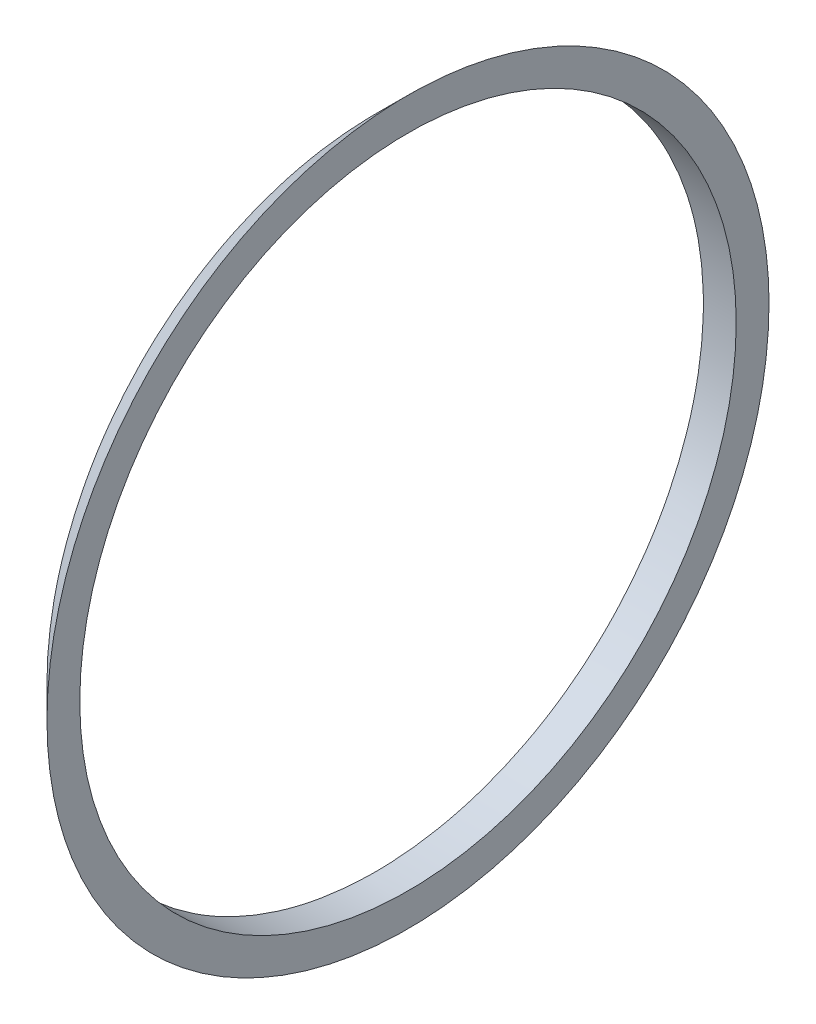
ISO-10303-21;
HEADER;
FILE_DESCRIPTION(('STEP AP214'),'2;1');
FILE_NAME('part.step','',(''),(''),'','','');
FILE_SCHEMA(('AUTOMOTIVE_DESIGN { 1 0 10303 214 1 1 1 1 }'));
ENDSEC;
DATA;
#1=APPLICATION_CONTEXT('core data for automotive mechanical design processes');
#2=APPLICATION_PROTOCOL_DEFINITION('international standard','automotive_design',2000,#1);
#3=PRODUCT_CONTEXT('',#1,'mechanical');
#4=PRODUCT('Part','Part','',(#3));
#5=PRODUCT_RELATED_PRODUCT_CATEGORY('part','',(#4));
#6=PRODUCT_DEFINITION_FORMATION('','',#4);
#7=PRODUCT_DEFINITION_CONTEXT('part definition',#1,'design');
#8=PRODUCT_DEFINITION('design','',#6,#7);
#9=PRODUCT_DEFINITION_SHAPE('','',#8);
#10=(LENGTH_UNIT() NAMED_UNIT(*) SI_UNIT(.MILLI.,.METRE.));
#11=(NAMED_UNIT(*) PLANE_ANGLE_UNIT() SI_UNIT($,.RADIAN.));
#12=(NAMED_UNIT(*) SI_UNIT($,.STERADIAN.) SOLID_ANGLE_UNIT());
#13=UNCERTAINTY_MEASURE_WITH_UNIT(LENGTH_MEASURE(1.E-05),#10,'distance_accuracy_value','');
#14=(GEOMETRIC_REPRESENTATION_CONTEXT(3) GLOBAL_UNCERTAINTY_ASSIGNED_CONTEXT((#13)) GLOBAL_UNIT_ASSIGNED_CONTEXT((#10,
#11,#12)) REPRESENTATION_CONTEXT('',''));
#15=CARTESIAN_POINT('',(0.,0.,0.));
#16=DIRECTION('',(0.,0.,1.));
#17=DIRECTION('',(1.,0.,0.));
#18=AXIS2_PLACEMENT_3D('',#15,#16,#17);
#19=CARTESIAN_POINT('',(50.7516600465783,83.5027630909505,0.57122631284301));
#20=DIRECTION('',(1.,0.,0.));
#21=DIRECTION('',(0.,0.,-1.));
#22=AXIS2_PLACEMENT_3D('',#19,#20,#21);
#23=PLANE('',#22);
#24=CARTESIAN_POINT('',(50.7516600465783,11.0027630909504,83.071226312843));
#25=CARTESIAN_POINT('',(50.7516600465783,12.8146587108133,83.0712236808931));
#26=CARTESIAN_POINT('',(50.7516600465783,14.6265383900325,83.0109734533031));
#27=CARTESIAN_POINT('',(50.7516600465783,18.2422925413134,82.7717597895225));
#28=CARTESIAN_POINT('',(50.7516600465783,20.0461674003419,82.5928021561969));
#29=CARTESIAN_POINT('',(50.7516600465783,23.6391857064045,82.1170843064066));
#30=CARTESIAN_POINT('',(50.7516600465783,25.4283232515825,81.8202790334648));
#31=CARTESIAN_POINT('',(50.7516600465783,28.0942343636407,81.286945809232));
#32=CARTESIAN_POINT('',(50.7516600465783,28.980024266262,81.0944484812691));
#33=CARTESIAN_POINT('',(50.7516600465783,30.7447410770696,80.6802577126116));
#34=CARTESIAN_POINT('',(50.7516600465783,31.6236682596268,80.4585654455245));
#35=CARTESIAN_POINT('',(50.7516600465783,33.6179241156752,79.920332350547));
#36=CARTESIAN_POINT('',(50.7516600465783,34.7307786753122,79.594587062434));
#37=CARTESIAN_POINT('',(50.7516600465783,36.9417789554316,78.896402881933));
#38=CARTESIAN_POINT('',(50.7516600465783,38.0399240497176,78.5239620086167));
#39=CARTESIAN_POINT('',(50.7516600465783,40.2197338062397,77.7331119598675));
#40=CARTESIAN_POINT('',(50.7516600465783,41.3013958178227,77.3146954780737));
#41=CARTESIAN_POINT('',(50.7516600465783,43.4462011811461,76.4328557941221));
#42=CARTESIAN_POINT('',(50.7516600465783,44.5093447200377,75.9694330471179));
#43=CARTESIAN_POINT('',(50.7516600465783,46.6157830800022,74.9979771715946));
#44=CARTESIAN_POINT('',(50.7516600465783,47.6590663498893,74.4899189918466));
#45=CARTESIAN_POINT('',(50.7516600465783,49.7232471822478,73.4301947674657));
#46=CARTESIAN_POINT('',(50.7516600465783,50.7441447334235,72.8785287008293));
#47=CARTESIAN_POINT('',(50.7516600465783,52.7616426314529,71.7325314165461));
#48=CARTESIAN_POINT('',(50.7516600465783,53.7582441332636,71.138202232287));
#49=CARTESIAN_POINT('',(50.7516600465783,55.7253748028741,69.9078618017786));
#50=CARTESIAN_POINT('',(50.7516600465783,56.6959040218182,69.2718506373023));
#51=CARTESIAN_POINT('',(50.7516600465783,58.60818635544,67.9601108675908));
#52=CARTESIAN_POINT('',(50.7516600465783,59.5499695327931,67.2844260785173));
#53=CARTESIAN_POINT('',(50.7516600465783,61.4043894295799,65.894163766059));
#54=CARTESIAN_POINT('',(50.7516600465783,62.3170259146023,65.1795859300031));
#55=CARTESIAN_POINT('',(50.7516600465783,64.1115641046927,63.7128207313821));
#56=CARTESIAN_POINT('',(50.7516600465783,64.9934654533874,62.9606329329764));
#57=CARTESIAN_POINT('',(50.7516600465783,66.7248928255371,61.4198332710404));
#58=CARTESIAN_POINT('',(50.7516600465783,67.5744192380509,60.6312218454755));
#59=CARTESIAN_POINT('',(50.7516600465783,68.8229748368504,59.4219334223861));
#60=CARTESIAN_POINT('',(50.7516600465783,69.2348591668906,59.0144545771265));
#61=CARTESIAN_POINT('',(50.7516600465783,70.0498710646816,58.1908316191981));
#62=CARTESIAN_POINT('',(50.7516600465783,70.4529986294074,57.774687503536));
#63=CARTESIAN_POINT('',(50.7516600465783,71.6490502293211,56.5136163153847));
#64=CARTESIAN_POINT('',(50.7516600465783,72.4286828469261,55.6560119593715));
#65=CARTESIAN_POINT('',(50.7516600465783,73.9512283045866,53.9088641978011));
#66=CARTESIAN_POINT('',(50.7516600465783,74.6941412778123,53.0193209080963));
#67=CARTESIAN_POINT('',(50.7516600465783,76.1420664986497,51.209895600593));
#68=CARTESIAN_POINT('',(50.7516600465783,76.8470787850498,50.2900136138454));
#69=CARTESIAN_POINT('',(50.7516600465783,78.219523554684,48.4192389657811));
#70=CARTESIAN_POINT('',(50.7516600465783,78.8868621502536,47.4682774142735));
#71=CARTESIAN_POINT('',(50.7516600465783,80.1806484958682,45.5389431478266));
#72=CARTESIAN_POINT('',(50.7516600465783,80.8070963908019,44.5605705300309));
#73=CARTESIAN_POINT('',(50.7516600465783,82.0179303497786,42.5781775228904));
#74=CARTESIAN_POINT('',(50.7516600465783,82.6023187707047,41.5741585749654));
#75=CARTESIAN_POINT('',(50.7516600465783,83.7280882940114,39.5422663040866));
#76=CARTESIAN_POINT('',(50.7516600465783,84.2694644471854,38.5143902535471));
#77=CARTESIAN_POINT('',(50.7516600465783,85.8276550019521,35.3978393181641));
#78=CARTESIAN_POINT('',(50.7516600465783,86.7788725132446,33.2756830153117));
#79=CARTESIAN_POINT('',(50.7516600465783,88.069167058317,30.0390918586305));
#80=CARTESIAN_POINT('',(50.7516600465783,88.4765469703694,28.9512136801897));
#81=CARTESIAN_POINT('',(50.7516600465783,89.2450594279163,26.7591249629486));
#82=CARTESIAN_POINT('',(50.7516600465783,89.6061920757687,25.6549144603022));
#83=CARTESIAN_POINT('',(50.7516600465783,90.2807519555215,23.4343643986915));
#84=CARTESIAN_POINT('',(50.7516600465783,90.5942694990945,22.3180522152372));
#85=CARTESIAN_POINT('',(50.7516600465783,91.1738208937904,20.0731658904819));
#86=CARTESIAN_POINT('',(50.7516600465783,91.4398550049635,18.944591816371));
#87=CARTESIAN_POINT('',(50.7516600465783,91.9239063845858,16.6771926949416));
#88=CARTESIAN_POINT('',(50.7516600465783,92.1419234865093,15.5383676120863));
#89=CARTESIAN_POINT('',(50.7516600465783,92.5298377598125,13.2525460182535));
#90=CARTESIAN_POINT('',(50.7516600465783,92.6997345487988,12.1055494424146));
#91=CARTESIAN_POINT('',(50.7516600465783,92.9913155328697,9.80544163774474));
#92=CARTESIAN_POINT('',(50.7516600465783,93.112999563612,8.65233038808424));
#93=CARTESIAN_POINT('',(50.7516600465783,93.3078973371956,6.3420252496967));
#94=CARTESIAN_POINT('',(50.7516600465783,93.3811114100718,5.18483138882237));
#95=CARTESIAN_POINT('',(50.7516600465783,93.4786941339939,2.86837429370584));
#96=CARTESIAN_POINT('',(50.7516600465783,93.503062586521,1.70911105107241));
#97=CARTESIAN_POINT('',(50.7516600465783,93.5024580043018,-0.609402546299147));
#98=CARTESIAN_POINT('',(50.7516600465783,93.47748496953,-1.76865290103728));
#99=CARTESIAN_POINT('',(50.7516600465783,93.3787282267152,-4.08440489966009));
#100=CARTESIAN_POINT('',(50.7516600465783,93.3049722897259,-5.24090773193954));
#101=CARTESIAN_POINT('',(50.7516600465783,93.109048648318,-7.54981150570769));
#102=CARTESIAN_POINT('',(50.7516600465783,92.9868806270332,-8.70221242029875));
#103=CARTESIAN_POINT('',(50.7516600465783,92.6943885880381,-11.0008834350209));
#104=CARTESIAN_POINT('',(50.7516600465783,92.5240647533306,-12.1471535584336));
#105=CARTESIAN_POINT('',(50.7516600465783,92.1353503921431,-14.4315095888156));
#106=CARTESIAN_POINT('',(50.7516600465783,91.9169602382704,-15.5695955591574));
#107=CARTESIAN_POINT('',(50.7516600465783,91.4322219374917,-17.8355025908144));
#108=CARTESIAN_POINT('',(50.7516600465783,91.1658741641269,-18.9633237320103));
#109=CARTESIAN_POINT('',(50.7516600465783,90.585755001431,-21.2066992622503));
#110=CARTESIAN_POINT('',(50.7516600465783,90.271983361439,-22.3222535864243));
#111=CARTESIAN_POINT('',(50.7516600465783,89.5976207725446,-24.5391603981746));
#112=CARTESIAN_POINT('',(50.7516600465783,89.2370294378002,-25.6405127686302));
#113=CARTESIAN_POINT('',(50.7516600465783,88.4698342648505,-27.8269541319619));
#114=CARTESIAN_POINT('',(50.7516600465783,88.0632303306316,-28.912043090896));
#115=CARTESIAN_POINT('',(50.7516600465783,86.77438092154,-32.1434624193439));
#116=CARTESIAN_POINT('',(50.7516600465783,85.8239168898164,-34.2632560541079));
#117=CARTESIAN_POINT('',(50.7516600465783,84.2671445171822,-37.3763803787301));
#118=CARTESIAN_POINT('',(50.7516600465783,83.7262932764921,-38.4031269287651));
#119=CARTESIAN_POINT('',(50.7516600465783,82.6016663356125,-40.4328099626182));
#120=CARTESIAN_POINT('',(50.7516600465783,82.0178955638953,-41.4357491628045));
#121=CARTESIAN_POINT('',(50.7516600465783,80.8083731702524,-43.4160601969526));
#122=CARTESIAN_POINT('',(50.7516600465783,80.182618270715,-44.3934300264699));
#123=CARTESIAN_POINT('',(50.7516600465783,78.8903014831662,-46.3208186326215));
#124=CARTESIAN_POINT('',(50.7516600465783,78.2237394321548,-47.2708372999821));
#125=CARTESIAN_POINT('',(50.7516600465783,76.8512853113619,-49.1420279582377));
#126=CARTESIAN_POINT('',(50.7516600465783,76.1453931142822,-50.0631998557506));
#127=CARTESIAN_POINT('',(50.7516600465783,74.6956045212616,-51.8751253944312));
#128=CARTESIAN_POINT('',(50.7516600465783,73.9517080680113,-52.7658789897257));
#129=CARTESIAN_POINT('',(50.7516600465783,72.4269448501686,-54.515535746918));
#130=CARTESIAN_POINT('',(50.7516600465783,71.6460706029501,-55.3744323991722));
#131=CARTESIAN_POINT('',(50.7516600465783,70.4480759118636,-56.637361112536));
#132=CARTESIAN_POINT('',(50.7516600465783,70.0442871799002,-57.0541109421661));
#133=CARTESIAN_POINT('',(50.7516600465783,69.2279266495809,-57.8789174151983));
#134=CARTESIAN_POINT('',(50.7516600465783,68.8153548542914,-58.2869740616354));
#135=CARTESIAN_POINT('',(50.7516600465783,67.5647975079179,-59.4978588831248));
#136=CARTESIAN_POINT('',(50.7516600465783,66.7139234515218,-60.2874510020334));
#137=CARTESIAN_POINT('',(50.7516600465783,64.9797164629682,-61.8301024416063));
#138=CARTESIAN_POINT('',(50.7516600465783,64.0963831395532,-62.5831613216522));
#139=CARTESIAN_POINT('',(50.7516600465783,62.2989150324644,-64.0515440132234));
#140=CARTESIAN_POINT('',(50.7516600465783,61.3847810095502,-64.7668687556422));
#141=CARTESIAN_POINT('',(50.7516600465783,59.5272951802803,-66.1585046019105));
#142=CARTESIAN_POINT('',(50.7516600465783,58.5839436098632,-66.8348160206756));
#143=CARTESIAN_POINT('',(50.7516600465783,56.669501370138,-68.1469670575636));
#144=CARTESIAN_POINT('',(50.7516600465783,55.6984108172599,-68.7828068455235));
#145=CARTESIAN_POINT('',(50.7516600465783,53.7301583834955,-70.012767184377));
#146=CARTESIAN_POINT('',(50.7516600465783,52.7329964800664,-70.606887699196));
#147=CARTESIAN_POINT('',(50.7516600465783,50.7157276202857,-71.7516657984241));
#148=CARTESIAN_POINT('',(50.7516600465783,49.6956518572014,-72.302378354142));
#149=CARTESIAN_POINT('',(50.7516600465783,47.6331736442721,-73.3602778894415));
#150=CARTESIAN_POINT('',(50.7516600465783,46.5907711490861,-73.8674647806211));
#151=CARTESIAN_POINT('',(50.7516600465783,44.4855490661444,-74.8375400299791));
#152=CARTESIAN_POINT('',(50.7516600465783,43.4227293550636,-75.3004281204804));
#153=CARTESIAN_POINT('',(50.7516600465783,41.2786132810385,-76.1812274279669));
#154=CARTESIAN_POINT('',(50.7516600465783,40.1973169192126,-76.5991386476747));
#155=CARTESIAN_POINT('',(50.7516600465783,38.0180752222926,-77.3890828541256));
#156=CARTESIAN_POINT('',(50.7516600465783,36.9201296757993,-77.7611152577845));
#157=CARTESIAN_POINT('',(50.7516600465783,34.7095180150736,-78.458513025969));
#158=CARTESIAN_POINT('',(50.7516600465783,33.5968519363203,-78.783878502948));
#159=CARTESIAN_POINT('',(50.7516600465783,31.3587622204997,-79.3872912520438));
#160=CARTESIAN_POINT('',(50.7516600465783,30.2333385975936,-79.6653385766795));
#161=CARTESIAN_POINT('',(50.7516600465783,27.9717318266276,-80.1735482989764));
#162=CARTESIAN_POINT('',(50.7516600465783,26.8355486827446,-80.403710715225));
#163=CARTESIAN_POINT('',(50.7516600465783,24.5546713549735,-80.8158935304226));
#164=CARTESIAN_POINT('',(50.7516600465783,23.4099785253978,-80.9979214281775));
#165=CARTESIAN_POINT('',(50.7516600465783,21.1139613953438,-81.3138493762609));
#166=CARTESIAN_POINT('',(50.7516600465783,19.9626370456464,-81.4477490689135));
#167=CARTESIAN_POINT('',(50.7516600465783,17.6553967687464,-81.6671867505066));
#168=CARTESIAN_POINT('',(50.7516600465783,16.4994808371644,-81.7527246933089));
#169=CARTESIAN_POINT('',(50.7516600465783,14.1850449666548,-81.8751074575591));
#170=CARTESIAN_POINT('',(50.7516600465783,13.0265250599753,-81.9119528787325));
#171=CARTESIAN_POINT('',(50.7516600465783,11.288418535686,-81.9303205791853));
#172=CARTESIAN_POINT('',(50.7516600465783,10.7089749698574,-81.9302924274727));
#173=CARTESIAN_POINT('',(50.7516600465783,9.55021902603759,-81.9179305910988));
#174=CARTESIAN_POINT('',(50.7516600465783,8.97090664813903,-81.9055968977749));
#175=CARTESIAN_POINT('',(50.7516600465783,7.23355595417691,-81.8502516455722));
#176=CARTESIAN_POINT('',(50.7516600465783,6.07605026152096,-81.7888964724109));
#177=CARTESIAN_POINT('',(50.7516600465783,3.76467450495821,-81.6176714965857));
#178=CARTESIAN_POINT('',(50.7516600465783,2.61080443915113,-81.507801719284));
#179=CARTESIAN_POINT('',(50.7516600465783,0.308671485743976,-81.2398300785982));
#180=CARTESIAN_POINT('',(50.7516600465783,-0.83959141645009,-81.0817283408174));
#181=CARTESIAN_POINT('',(50.7516600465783,-3.13117053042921,-80.7170097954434));
#182=CARTESIAN_POINT('',(50.7516600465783,-4.2744686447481,-80.510279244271));
#183=CARTESIAN_POINT('',(50.7516600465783,-6.55127301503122,-80.0485341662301));
#184=CARTESIAN_POINT('',(50.7516600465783,-7.684779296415,-79.7935197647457));
#185=CARTESIAN_POINT('',(50.7516600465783,-9.9399633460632,-79.2356754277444));
#186=CARTESIAN_POINT('',(50.7516600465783,-11.0616411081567,-78.9328454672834));
#187=CARTESIAN_POINT('',(50.7516600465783,-13.2911721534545,-78.2799730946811));
#188=CARTESIAN_POINT('',(50.7516600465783,-14.3990254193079,-77.9299306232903));
#189=CARTESIAN_POINT('',(50.7516600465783,-16.5989272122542,-77.183362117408));
#190=CARTESIAN_POINT('',(50.7516600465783,-17.6909760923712,-76.7868371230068));
#191=CARTESIAN_POINT('',(50.7516600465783,-19.8574164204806,-75.9481762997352));
#192=CARTESIAN_POINT('',(50.7516600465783,-20.9318078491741,-75.5060404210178));
#193=CARTESIAN_POINT('',(50.7516600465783,-23.0610353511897,-74.5769631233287));
#194=CARTESIAN_POINT('',(50.7516600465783,-24.1158715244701,-74.0900219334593));
#195=CARTESIAN_POINT('',(50.7516600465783,-26.2040363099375,-73.0720222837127));
#196=CARTESIAN_POINT('',(50.7516600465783,-27.2373649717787,-72.5409639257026));
#197=CARTESIAN_POINT('',(50.7516600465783,-29.2784513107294,-71.4367613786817));
#198=CARTESIAN_POINT('',(50.7516600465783,-30.2862586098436,-70.863708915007));
#199=CARTESIAN_POINT('',(50.7516600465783,-32.2768518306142,-69.6754311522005));
#200=CARTESIAN_POINT('',(50.7516600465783,-33.2596349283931,-69.0602011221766));
#201=CARTESIAN_POINT('',(50.7516600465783,-35.1982834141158,-67.7886960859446));
#202=CARTESIAN_POINT('',(50.7516600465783,-36.1541486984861,-67.1324209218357));
#203=CARTESIAN_POINT('',(50.7516600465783,-38.0373347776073,-65.7803406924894));
#204=CARTESIAN_POINT('',(50.7516600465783,-38.9646587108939,-65.0845399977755));
#205=CARTESIAN_POINT('',(50.7516600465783,-40.7894012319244,-63.6546522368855));
#206=CARTESIAN_POINT('',(50.7516600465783,-41.6868178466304,-62.9205626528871));
#207=CARTESIAN_POINT('',(50.7516600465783,-43.4500613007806,-61.4153888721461));
#208=CARTESIAN_POINT('',(50.7516600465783,-44.3158884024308,-60.6443049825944));
#209=CARTESIAN_POINT('',(50.7516600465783,-46.0142313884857,-59.0662692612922));
#210=CARTESIAN_POINT('',(50.7516600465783,-46.8467471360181,-58.259317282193));
#211=CARTESIAN_POINT('',(50.7516600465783,-48.4767083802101,-56.6107377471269));
#212=CARTESIAN_POINT('',(50.7516600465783,-49.2741538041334,-55.7691101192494));
#213=CARTESIAN_POINT('',(50.7516600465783,-50.8325544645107,-54.0534222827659));
#214=CARTESIAN_POINT('',(50.7516600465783,-51.5935259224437,-53.1793768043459));
#215=CARTESIAN_POINT('',(50.7516600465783,-53.0781741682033,-51.4001595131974));
#216=CARTESIAN_POINT('',(50.7516600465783,-53.8018507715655,-50.4949875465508));
#217=CARTESIAN_POINT('',(50.7516600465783,-55.2106504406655,-48.6551265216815));
#218=CARTESIAN_POINT('',(50.7516600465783,-55.8957736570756,-47.7204375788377));
#219=CARTESIAN_POINT('',(50.7516600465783,-57.2260501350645,-45.8230410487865));
#220=CARTESIAN_POINT('',(50.7516600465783,-57.8712036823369,-44.8603336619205));
#221=CARTESIAN_POINT('',(50.7516600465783,-59.1201908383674,-42.9084883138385));
#222=CARTESIAN_POINT('',(50.7516600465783,-59.7240247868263,-41.9193505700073));
#223=CARTESIAN_POINT('',(50.7516600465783,-60.8893576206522,-39.9164383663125));
#224=CARTESIAN_POINT('',(50.7516600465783,-61.4508562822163,-38.9026637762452));
#225=CARTESIAN_POINT('',(50.7516600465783,-62.5305791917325,-36.852315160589));
#226=CARTESIAN_POINT('',(50.7516600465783,-63.0488030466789,-35.8157409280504));
#227=CARTESIAN_POINT('',(50.7516600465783,-64.0411547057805,-33.7216963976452));
#228=CARTESIAN_POINT('',(50.7516600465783,-64.515282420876,-32.6642260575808));
#229=CARTESIAN_POINT('',(50.7516600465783,-65.4194425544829,-30.528773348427));
#230=CARTESIAN_POINT('',(50.7516600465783,-65.8494093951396,-29.4507632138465));
#231=CARTESIAN_POINT('',(50.7516600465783,-66.6635833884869,-27.277599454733));
#232=CARTESIAN_POINT('',(50.7516600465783,-67.0477906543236,-26.1824458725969));
#233=CARTESIAN_POINT('',(50.7516600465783,-67.7696337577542,-23.9768378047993));
#234=CARTESIAN_POINT('',(50.7516600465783,-68.1072674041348,-22.8663826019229));
#235=CARTESIAN_POINT('',(50.7516600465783,-68.7352198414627,-20.6323100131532));
#236=CARTESIAN_POINT('',(50.7516600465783,-69.0255440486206,-19.5086941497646));
#237=CARTESIAN_POINT('',(50.7516600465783,-69.5583587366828,-17.2500868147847));
#238=CARTESIAN_POINT('',(50.7516600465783,-69.8008455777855,-16.1150944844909));
#239=CARTESIAN_POINT('',(50.7516600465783,-70.2376026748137,-13.8358690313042));
#240=CARTESIAN_POINT('',(50.7516600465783,-70.4318726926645,-12.6916358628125));
#241=CARTESIAN_POINT('',(50.7516600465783,-70.7721892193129,-10.3960176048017));
#242=CARTESIAN_POINT('',(50.7516600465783,-70.9182355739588,-9.2446324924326));
#243=CARTESIAN_POINT('',(50.7516600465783,-71.161906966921,-6.93675961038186));
#244=CARTESIAN_POINT('',(50.7516600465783,-71.25953201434,-5.78027184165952));
#245=CARTESIAN_POINT('',(50.7516600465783,-71.406060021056,-3.46403013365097));
#246=CARTESIAN_POINT('',(50.7516600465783,-71.4549570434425,-2.30427581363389));
#247=CARTESIAN_POINT('',(50.7516600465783,-71.4914103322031,-0.563946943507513));
#248=CARTESIAN_POINT('',(50.7516600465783,-71.4974124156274,0.0162931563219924));
#249=CARTESIAN_POINT('',(50.7516600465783,-71.4970535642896,1.17676957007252));
#250=CARTESIAN_POINT('',(50.7516600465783,-71.4906926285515,1.75700588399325));
#251=CARTESIAN_POINT('',(50.7516600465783,-71.4531663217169,3.49730038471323));
#252=CARTESIAN_POINT('',(50.7516600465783,-71.4035588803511,4.65701280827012));
#253=CARTESIAN_POINT('',(50.7516600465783,-71.2556063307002,6.97329562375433));
#254=CARTESIAN_POINT('',(50.7516600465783,-71.1572606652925,8.12986597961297));
#255=CARTESIAN_POINT('',(50.7516600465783,-70.9121426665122,10.4378473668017));
#256=CARTESIAN_POINT('',(50.7516600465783,-70.7653714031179,11.5892585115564));
#257=CARTESIAN_POINT('',(50.7516600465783,-70.4235975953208,13.8848910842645));
#258=CARTESIAN_POINT('',(50.7516600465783,-70.2285954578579,15.0291125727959));
#259=CARTESIAN_POINT('',(50.7516600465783,-69.7903657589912,17.3082823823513));
#260=CARTESIAN_POINT('',(50.7516600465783,-69.5471384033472,18.4432307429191));
#261=CARTESIAN_POINT('',(50.7516600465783,-69.0128212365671,20.7018055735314));
#262=CARTESIAN_POINT('',(50.7516600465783,-68.7217313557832,21.8254320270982));
#263=CARTESIAN_POINT('',(50.7516600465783,-68.092705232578,24.0578415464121));
#264=CARTESIAN_POINT('',(50.7516600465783,-67.7548333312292,25.1666427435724));
#265=CARTESIAN_POINT('',(50.7516600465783,-67.0326276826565,27.3690099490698));
#266=CARTESIAN_POINT('',(50.7516600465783,-66.6482938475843,28.4625759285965));
#267=CARTESIAN_POINT('',(50.7516600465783,-65.83399203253,30.6325870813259));
#268=CARTESIAN_POINT('',(50.7516600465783,-65.4040238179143,31.7090321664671));
#269=CARTESIAN_POINT('',(50.7516600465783,-64.4993196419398,33.8429428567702));
#270=CARTESIAN_POINT('',(50.7516600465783,-64.0245836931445,34.9004084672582));
#271=CARTESIAN_POINT('',(50.7516600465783,-63.0310042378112,36.9944149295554));
#272=CARTESIAN_POINT('',(50.7516600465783,-62.5121607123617,38.0309557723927));
#273=CARTESIAN_POINT('',(50.7516600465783,-61.4311859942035,40.0812140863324));
#274=CARTESIAN_POINT('',(50.7516600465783,-60.8690548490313,41.0949315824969));
#275=CARTESIAN_POINT('',(50.7516600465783,-59.7024477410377,43.0977011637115));
#276=CARTESIAN_POINT('',(50.7516600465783,-59.097971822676,44.0867532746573));
#277=CARTESIAN_POINT('',(50.7516600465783,-57.8477006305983,46.0383864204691));
#278=CARTESIAN_POINT('',(50.7516600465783,-57.2019053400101,47.0009674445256));
#279=CARTESIAN_POINT('',(50.7516600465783,-55.8703805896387,48.8980326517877));
#280=CARTESIAN_POINT('',(50.7516600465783,-55.1846528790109,49.8325180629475));
#281=CARTESIAN_POINT('',(50.7516600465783,-53.7746457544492,51.6719449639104));
#282=CARTESIAN_POINT('',(50.7516600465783,-53.0503660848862,52.5768862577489));
#283=CARTESIAN_POINT('',(50.7516600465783,-51.5645089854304,54.3556180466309));
#284=CARTESIAN_POINT('',(50.7516600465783,-50.8029314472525,55.2294084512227));
#285=CARTESIAN_POINT('',(50.7516600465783,-49.2436793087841,56.944155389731));
#286=CARTESIAN_POINT('',(50.7516600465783,-48.446005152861,57.7851123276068));
#287=CARTESIAN_POINT('',(50.7516600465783,-46.8155445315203,59.4324290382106));
#288=CARTESIAN_POINT('',(50.7516600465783,-45.9827547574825,60.2387855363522));
#289=CARTESIAN_POINT('',(50.7516600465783,-44.283886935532,61.815643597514));
#290=CARTESIAN_POINT('',(50.7516600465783,-43.4178085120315,62.5861447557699));
#291=CARTESIAN_POINT('',(50.7516600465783,-41.6541074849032,64.0901383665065));
#292=CARTESIAN_POINT('',(50.7516600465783,-40.7564851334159,64.8236311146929));
#293=CARTESIAN_POINT('',(50.7516600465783,-38.9313056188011,66.2523684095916));
#294=CARTESIAN_POINT('',(50.7516600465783,-38.0037485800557,66.9476131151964));
#295=CARTESIAN_POINT('',(50.7516600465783,-36.1178810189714,68.3001797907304));
#296=CARTESIAN_POINT('',(50.7516600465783,-35.1594997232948,68.9574031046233));
#297=CARTESIAN_POINT('',(50.7516600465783,-33.2157193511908,70.2306033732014));
#298=CARTESIAN_POINT('',(50.7516600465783,-32.2303203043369,70.8465803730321));
#299=CARTESIAN_POINT('',(50.7516600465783,-30.2342670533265,72.0362316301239));
#300=CARTESIAN_POINT('',(50.7516600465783,-29.2236120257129,72.609904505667));
#301=CARTESIAN_POINT('',(50.7516600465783,-27.1789217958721,73.7139508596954));
#302=CARTESIAN_POINT('',(50.7516600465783,-26.1448865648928,74.2443242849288));
#303=CARTESIAN_POINT('',(50.7516600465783,-24.0557059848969,75.2607334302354));
#304=CARTESIAN_POINT('',(50.7516600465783,-23.0005682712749,75.7467848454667));
#305=CARTESIAN_POINT('',(50.7516600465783,-20.8707802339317,76.6740784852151));
#306=CARTESIAN_POINT('',(50.7516600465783,-19.7961297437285,77.115320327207));
#307=CARTESIAN_POINT('',(50.7516600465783,-17.6293153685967,77.9521377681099));
#308=CARTESIAN_POINT('',(50.7516600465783,-16.5371535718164,78.3477187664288));
#309=CARTESIAN_POINT('',(50.7516600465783,-14.3372057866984,79.092367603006));
#310=CARTESIAN_POINT('',(50.7516600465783,-13.229420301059,79.4414369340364));
#311=CARTESIAN_POINT('',(50.7516600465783,-10.2397643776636,80.3143360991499));
#312=CARTESIAN_POINT('',(50.7516600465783,-8.34503091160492,80.7950717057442));
#313=CARTESIAN_POINT('',(50.7516600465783,-5.48143164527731,81.4138464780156));
#314=CARTESIAN_POINT('',(50.7516600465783,-4.52327568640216,81.6030556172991));
#315=CARTESIAN_POINT('',(50.7516600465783,-2.60082861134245,81.9473378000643));
#316=CARTESIAN_POINT('',(50.7516600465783,-1.63653744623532,82.1024105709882));
#317=CARTESIAN_POINT('',(50.7516600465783,1.26248969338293,82.5162062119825));
#318=CARTESIAN_POINT('',(50.7516600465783,3.20476353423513,82.7238048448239));
#319=CARTESIAN_POINT('',(50.7516600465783,7.09895229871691,83.0013143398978));
#320=CARTESIAN_POINT('',(50.7516600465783,9.05086694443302,83.071229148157));
#321=CARTESIAN_POINT('',(50.7516600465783,11.0027630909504,83.071226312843));
#322=B_SPLINE_CURVE_WITH_KNOTS('',3,(#24,#25,#26,#27,#28,#29,#30,#31,#32,#33,#34,#35,#36,#37,
#38,#39,#40,#41,#42,#43,#44,#45,#46,#47,#48,#49,#50,#51,#52,#53,#54,#55,#56,#57,#58,#59,#60,#61,
#62,#63,#64,#65,#66,#67,#68,#69,#70,#71,#72,#73,#74,#75,#76,#77,#78,#79,#80,#81,#82,#83,#84,#85,
#86,#87,#88,#89,#90,#91,#92,#93,#94,#95,#96,#97,#98,#99,#100,#101,#102,#103,#104,#105,#106,#107,
#108,#109,#110,#111,#112,#113,#114,#115,#116,#117,#118,#119,#120,#121,#122,#123,#124,#125,#126,
#127,#128,#129,#130,#131,#132,#133,#134,#135,#136,#137,#138,#139,#140,#141,#142,#143,#144,#145,
#146,#147,#148,#149,#150,#151,#152,#153,#154,#155,#156,#157,#158,#159,#160,#161,#162,#163,#164,
#165,#166,#167,#168,#169,#170,#171,#172,#173,#174,#175,#176,#177,#178,#179,#180,#181,#182,#183,
#184,#185,#186,#187,#188,#189,#190,#191,#192,#193,#194,#195,#196,#197,#198,#199,#200,#201,#202,
#203,#204,#205,#206,#207,#208,#209,#210,#211,#212,#213,#214,#215,#216,#217,#218,#219,#220,#221,
#222,#223,#224,#225,#226,#227,#228,#229,#230,#231,#232,#233,#234,#235,#236,#237,#238,#239,#240,
#241,#242,#243,#244,#245,#246,#247,#248,#249,#250,#251,#252,#253,#254,#255,#256,#257,#258,#259,
#260,#261,#262,#263,#264,#265,#266,#267,#268,#269,#270,#271,#272,#273,#274,#275,#276,#277,#278,
#279,#280,#281,#282,#283,#284,#285,#286,#287,#288,#289,#290,#291,#292,#293,#294,#295,#296,#297,
#298,#299,#300,#301,#302,#303,#304,#305,#306,#307,#308,#309,#310,#311,#312,#313,#314,#315,#316,
#317,#318,#319,#320,#321),.UNSPECIFIED.,.T.,.F.,(4,2,2,2,2,2,2,2,2,2,2,2,2,2,2,2,2,2,2,2,2,2,2,
2,2,2,2,2,2,2,2,2,2,2,2,2,2,2,2,2,2,2,2,2,2,2,2,2,2,2,2,2,2,2,2,2,2,2,2,2,2,2,2,2,2,2,2,2,2,2,2,
2,2,2,2,2,2,2,2,2,2,2,2,2,2,2,2,2,2,2,2,2,2,2,2,2,2,2,2,2,2,2,2,2,2,2,2,2,2,2,2,2,2,2,2,2,2,2,2,
2,2,2,2,2,2,2,2,2,2,2,2,2,2,2,2,2,2,2,2,2,2,2,2,2,2,2,2,2,4),(0.,5.43467368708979,
10.8690817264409,16.3055694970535,19.0245497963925,21.7434208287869,25.2210019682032,
28.698730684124,32.1770128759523,35.6552598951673,39.1354716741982,42.615685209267,
46.0957329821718,49.5757739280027,53.0520412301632,56.5283364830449,60.0046720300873,
63.4809657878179,65.2190092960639,66.9570534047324,70.4329760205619,73.9088860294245,
77.3847924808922,80.869010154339,84.3532154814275,87.8372254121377,91.3216356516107,
98.2884986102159,101.77269090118,105.256875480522,108.734366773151,112.211839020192,
115.689323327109,119.166835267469,122.644359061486,126.121859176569,129.599373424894,
133.076887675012,136.552423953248,140.027982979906,143.503528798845,146.979047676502,
150.454539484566,153.930049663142,157.405588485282,160.881134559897,167.840635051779,
171.321315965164,174.801597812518,178.282151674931,181.762719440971,185.24329847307,
188.723882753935,192.205174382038,193.945903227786,195.686631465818,199.167885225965,
202.649180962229,206.130390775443,209.611572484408,213.092739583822,216.573909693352,
220.050597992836,223.527293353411,227.004009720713,230.480725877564,233.957486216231,
237.434238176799,240.910986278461,244.38773303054,247.863937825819,251.34016845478,
254.81640240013,258.292593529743,260.030810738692,261.769029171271,265.245304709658,
268.721578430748,272.197843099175,275.682321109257,279.16679007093,282.651260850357,
286.135736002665,289.620133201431,293.104534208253,296.588917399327,300.073292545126,
303.550271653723,307.027641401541,310.505024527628,313.98202388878,317.459252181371,
320.93645160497,324.413665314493,327.890886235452,331.366546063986,334.84222308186,
338.317886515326,341.793525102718,345.269135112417,348.744763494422,352.220423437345,
355.696090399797,359.176846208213,362.65759340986,366.138504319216,369.619016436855,
373.09979327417,376.58058729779,380.061392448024,383.542196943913,387.0234254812,
388.764125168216,390.504824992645,393.986018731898,397.467252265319,400.948408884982,
404.429536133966,407.910648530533,411.391765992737,414.86814244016,418.344525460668,
421.820926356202,425.297326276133,428.7737276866,432.250125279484,435.72651922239,
439.202914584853,442.679157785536,446.155424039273,449.631700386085,453.10793394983,
456.58449578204,460.061096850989,463.53767013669,467.014228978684,470.499437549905,
473.984642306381,477.469960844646,480.955283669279,484.439367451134,487.92348097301,
491.407182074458,494.890771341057,500.749247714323,503.678725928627,506.608227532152,
512.462992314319,518.317589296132),.UNSPECIFIED.);
#323=CARTESIAN_POINT('',(50.7516600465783,11.0027630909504,83.071226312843));
#324=VERTEX_POINT('',#323);
#325=EDGE_CURVE('E61',#324,#324,#322,.T.);
#326=ORIENTED_EDGE('',*,*,#325,.F.);
#327=EDGE_LOOP('',(#326));
#328=FACE_BOUND('',#327,.T.);
#329=CARTESIAN_POINT('',(50.7516600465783,11.0027630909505,0.57122631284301));
#330=DIRECTION('',(1.,0.,0.));
#331=DIRECTION('',(0.,0.,-1.));
#332=AXIS2_PLACEMENT_3D('',#329,#330,#331);
#333=CIRCLE('',#332,75.);
#334=CARTESIAN_POINT('',(50.7516600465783,11.0027630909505,-74.428773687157));
#335=VERTEX_POINT('',#334);
#336=EDGE_CURVE('E71',#335,#335,#333,.T.);
#337=ORIENTED_EDGE('',*,*,#336,.F.);
#338=EDGE_LOOP('',(#337));
#339=FACE_BOUND('',#338,.T.);
#340=ADVANCED_FACE('F54',(#328,#339),#23,.T.);
#341=CARTESIAN_POINT('',(-15.2483399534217,11.0027630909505,0.57122631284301));
#342=DIRECTION('',(-1.,0.,0.));
#343=DIRECTION('',(0.,0.,1.));
#344=AXIS2_PLACEMENT_3D('',#341,#342,#343);
#345=CYLINDRICAL_SURFACE('',#344,75.);
#346=ORIENTED_EDGE('',*,*,#336,.T.);
#347=EDGE_LOOP('',(#346));
#348=FACE_BOUND('',#347,.T.);
#349=CARTESIAN_POINT('',(43.2516600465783,11.0027630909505,75.571226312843));
#350=CARTESIAN_POINT('',(43.2516602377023,10.1035012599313,75.571226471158));
#351=CARTESIAN_POINT('',(43.2518156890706,9.20424581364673,75.5550512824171));
#352=CARTESIAN_POINT('',(43.252172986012,7.40689979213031,75.4903721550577));
#353=CARTESIAN_POINT('',(43.2523748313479,6.50880921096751,75.4418683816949));
#354=CARTESIAN_POINT('',(43.2526583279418,4.71499296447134,75.3125972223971));
#355=CARTESIAN_POINT('',(43.2527399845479,3.81926719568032,75.2318312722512));
#356=CARTESIAN_POINT('',(43.2527211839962,2.03130099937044,75.038141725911));
#357=CARTESIAN_POINT('',(43.2526207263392,1.13906058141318,74.9252180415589));
#358=CARTESIAN_POINT('',(43.252270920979,-0.640644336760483,74.6673751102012));
#359=CARTESIAN_POINT('',(43.2520215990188,-1.52810963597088,74.5224613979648));
#360=CARTESIAN_POINT('',(43.2515479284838,-3.29719574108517,74.2008384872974));
#361=CARTESIAN_POINT('',(43.2513235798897,-4.17881655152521,74.0241293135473));
#362=CARTESIAN_POINT('',(43.250869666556,-6.81337421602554,73.4465736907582));
#363=CARTESIAN_POINT('',(43.25085910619,-8.55626385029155,72.9982618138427));
#364=CARTESIAN_POINT('',(43.2510790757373,-11.1424542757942,72.2329214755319));
#365=CARTESIAN_POINT('',(43.2511917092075,-11.9998585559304,71.962317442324));
#366=CARTESIAN_POINT('',(43.2514355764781,-13.7044444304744,71.3904449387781));
#367=CARTESIAN_POINT('',(43.251566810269,-14.5516260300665,71.0891764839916));
#368=CARTESIAN_POINT('',(43.2517640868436,-16.2345724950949,70.4563879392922));
#369=CARTESIAN_POINT('',(43.2518301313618,-17.0703376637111,70.1248686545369));
#370=CARTESIAN_POINT('',(43.2518101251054,-18.7294114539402,69.4319984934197));
#371=CARTESIAN_POINT('',(43.2517240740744,-19.5527200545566,69.0706475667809));
#372=CARTESIAN_POINT('',(43.2515056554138,-21.186102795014,68.3184441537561));
#373=CARTESIAN_POINT('',(43.2513732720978,-21.9961723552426,67.9275817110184));
#374=CARTESIAN_POINT('',(43.2511372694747,-23.6016768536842,67.117012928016));
#375=CARTESIAN_POINT('',(43.2510336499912,-24.3971118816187,66.6973067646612));
#376=CARTESIAN_POINT('',(43.2508518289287,-26.7601758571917,65.3955545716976));
#377=CARTESIAN_POINT('',(43.250902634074,-28.304671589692,64.4708251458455));
#378=CARTESIAN_POINT('',(43.2514515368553,-30.6979180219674,62.9183620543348));
#379=CARTESIAN_POINT('',(43.2517557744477,-31.5700187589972,62.326141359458));
#380=CARTESIAN_POINT('',(43.2522995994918,-33.2885723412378,61.1054159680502));
#381=CARTESIAN_POINT('',(43.2525391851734,-34.1350244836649,60.4769102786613));
#382=CARTESIAN_POINT('',(43.2527658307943,-35.8007500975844,59.1847273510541));
#383=CARTESIAN_POINT('',(43.2527528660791,-36.620020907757,58.5210466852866));
#384=CARTESIAN_POINT('',(43.2525150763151,-38.2298572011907,57.159743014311));
#385=CARTESIAN_POINT('',(43.2522902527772,-39.0204228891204,56.4621202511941));
#386=CARTESIAN_POINT('',(43.2518597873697,-40.571720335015,55.0339166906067));
#387=CARTESIAN_POINT('',(43.2516541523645,-41.3324413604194,54.3033242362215));
#388=CARTESIAN_POINT('',(43.2516665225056,-42.822401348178,52.810709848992));
#389=CARTESIAN_POINT('',(43.2518845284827,-43.5516402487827,52.0486878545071));
#390=CARTESIAN_POINT('',(43.2523204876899,-44.9773170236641,50.4945930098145));
#391=CARTESIAN_POINT('',(43.2525384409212,-45.6737558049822,49.702520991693));
#392=CARTESIAN_POINT('',(43.2527586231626,-47.0326148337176,48.0897155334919));
#393=CARTESIAN_POINT('',(43.2527608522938,-47.695035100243,47.2689821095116));
#394=CARTESIAN_POINT('',(43.25251415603,-48.9845849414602,45.6004352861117));
#395=CARTESIAN_POINT('',(43.252265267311,-49.6117196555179,44.7526258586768));
#396=CARTESIAN_POINT('',(43.2517179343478,-50.8296877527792,43.0313206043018));
#397=CARTESIAN_POINT('',(43.2514194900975,-51.4205211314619,42.1578247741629));
#398=CARTESIAN_POINT('',(43.2510279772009,-52.5648393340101,40.3866946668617));
#399=CARTESIAN_POINT('',(43.2509349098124,-53.1183239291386,39.4890602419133));
#400=CARTESIAN_POINT('',(43.2509003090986,-54.1869565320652,37.6712540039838));
#401=CARTESIAN_POINT('',(43.2509587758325,-54.7021045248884,36.7510821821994));
#402=CARTESIAN_POINT('',(43.2511675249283,-55.6931061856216,34.8899156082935));
#403=CARTESIAN_POINT('',(43.2513177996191,-56.1689631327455,33.9489226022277));
#404=CARTESIAN_POINT('',(43.2516091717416,-57.0805845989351,32.0477124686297));
#405=CARTESIAN_POINT('',(43.2517502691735,-57.5163491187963,31.0874953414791));
#406=CARTESIAN_POINT('',(43.2518433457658,-58.3470103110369,29.1495457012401));
#407=CARTESIAN_POINT('',(43.2517953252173,-58.7419070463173,28.171813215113));
#408=CARTESIAN_POINT('',(43.2515858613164,-59.4901313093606,26.2005698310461));
#409=CARTESIAN_POINT('',(43.2514244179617,-59.8434588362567,25.2070589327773));
#410=CARTESIAN_POINT('',(43.2511405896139,-60.5079281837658,23.2059898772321));
#411=CARTESIAN_POINT('',(43.2510182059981,-60.8190685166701,22.1984312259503));
#412=CARTESIAN_POINT('',(43.2508953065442,-61.3985954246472,20.1710929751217));
#413=CARTESIAN_POINT('',(43.2508947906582,-61.6669820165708,19.1513133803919));
#414=CARTESIAN_POINT('',(43.2510738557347,-62.1605245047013,17.1013453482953));
#415=CARTESIAN_POINT('',(43.2512534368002,-62.3856803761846,16.0711569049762));
#416=CARTESIAN_POINT('',(43.2517579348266,-62.7923608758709,14.0022044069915));
#417=CARTESIAN_POINT('',(43.2520828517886,-62.9738855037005,12.9634403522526));
#418=CARTESIAN_POINT('',(43.2525573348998,-63.2929827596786,10.8791674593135));
#419=CARTESIAN_POINT('',(43.252706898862,-63.4305548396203,9.83365853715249));
#420=CARTESIAN_POINT('',(43.2527498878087,-63.6614992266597,7.73777957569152));
#421=CARTESIAN_POINT('',(43.2526433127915,-63.7548715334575,6.68740953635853));
#422=CARTESIAN_POINT('',(43.2522818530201,-63.8972505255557,4.58363247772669));
#423=CARTESIAN_POINT('',(43.2520269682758,-63.9462572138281,3.53022545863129));
#424=CARTESIAN_POINT('',(43.2517566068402,-63.986427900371,1.94933501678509));
#425=CARTESIAN_POINT('',(43.251685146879,-63.9942613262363,1.42222690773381));
#426=CARTESIAN_POINT('',(43.251648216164,-63.9988139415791,0.367962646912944));
#427=CARTESIAN_POINT('',(43.2516827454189,-63.9955331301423,-0.159193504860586));
#428=CARTESIAN_POINT('',(43.2518809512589,-63.9690172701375,-1.74036539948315));
#429=CARTESIAN_POINT('',(43.2521392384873,-63.9291104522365,-2.79414980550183));
#430=CARTESIAN_POINT('',(43.2525485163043,-63.8049071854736,-4.89906487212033));
#431=CARTESIAN_POINT('',(43.2526995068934,-63.7206107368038,-5.95019553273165));
#432=CARTESIAN_POINT('',(43.2527541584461,-63.5077782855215,-8.04797774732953));
#433=CARTESIAN_POINT('',(43.25265781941,-63.3792422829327,-9.09462930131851));
#434=CARTESIAN_POINT('',(43.2522509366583,-63.0781592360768,-11.1815804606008));
#435=CARTESIAN_POINT('',(43.2519403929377,-62.9056121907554,-12.221880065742));
#436=CARTESIAN_POINT('',(43.2514034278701,-62.5168139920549,-14.2942801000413));
#437=CARTESIAN_POINT('',(43.2511770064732,-62.3005628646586,-15.3263805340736));
#438=CARTESIAN_POINT('',(43.250920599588,-61.8247409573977,-17.3805467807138));
#439=CARTESIAN_POINT('',(43.2508906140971,-61.5651701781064,-18.4026125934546));
#440=CARTESIAN_POINT('',(43.2509634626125,-61.0031705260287,-20.4348924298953));
#441=CARTESIAN_POINT('',(43.251066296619,-60.7007416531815,-21.4451064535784));
#442=CARTESIAN_POINT('',(43.2513305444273,-60.0535635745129,-23.4518863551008));
#443=CARTESIAN_POINT('',(43.2514919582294,-59.7088143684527,-24.4484522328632));
#444=CARTESIAN_POINT('',(43.2517433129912,-58.9776084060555,-26.4261644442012));
#445=CARTESIAN_POINT('',(43.2518332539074,-58.5911516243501,-27.4073107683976));
#446=CARTESIAN_POINT('',(43.2518054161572,-57.7772178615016,-29.3524386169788));
#447=CARTESIAN_POINT('',(43.2516876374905,-57.3497408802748,-30.3164201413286));
#448=CARTESIAN_POINT('',(43.251411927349,-56.4545268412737,-32.2255042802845));
#449=CARTESIAN_POINT('',(43.2512539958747,-55.9867897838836,-33.1706068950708));
#450=CARTESIAN_POINT('',(43.2510122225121,-55.01188728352,-35.04025271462));
#451=CARTESIAN_POINT('',(43.2509283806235,-54.5047218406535,-35.9647959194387));
#452=CARTESIAN_POINT('',(43.250901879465,-53.4518647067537,-37.7916783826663));
#453=CARTESIAN_POINT('',(43.2509592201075,-52.9061730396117,-38.694017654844));
#454=CARTESIAN_POINT('',(43.2512793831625,-51.7772335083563,-40.4748883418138));
#455=CARTESIAN_POINT('',(43.2515422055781,-51.1939856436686,-41.3534197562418));
#456=CARTESIAN_POINT('',(43.2520924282,-49.9909708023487,-43.0851125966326));
#457=CARTESIAN_POINT('',(43.2523798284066,-49.3712038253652,-43.9382740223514));
#458=CARTESIAN_POINT('',(43.2527177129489,-48.0962527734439,-45.6177098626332));
#459=CARTESIAN_POINT('',(43.2527681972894,-47.4410686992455,-46.4439842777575));
#460=CARTESIAN_POINT('',(43.2526375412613,-46.09644829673,-48.0681770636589));
#461=CARTESIAN_POINT('',(43.2524564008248,-45.4070119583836,-48.866095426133));
#462=CARTESIAN_POINT('',(43.2520158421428,-43.9951131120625,-50.4321570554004));
#463=CARTESIAN_POINT('',(43.2517564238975,-43.2726506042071,-51.2003003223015));
#464=CARTESIAN_POINT('',(43.2516254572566,-41.7959840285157,-52.7054459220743));
#465=CARTESIAN_POINT('',(43.2517539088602,-41.041779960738,-53.4424482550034));
#466=CARTESIAN_POINT('',(43.252136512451,-39.5029713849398,-54.8840014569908));
#467=CARTESIAN_POINT('',(43.2523906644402,-38.7183668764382,-55.5885523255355));
#468=CARTESIAN_POINT('',(43.2527078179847,-37.1201522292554,-56.9639500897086));
#469=CARTESIAN_POINT('',(43.2527708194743,-36.3065420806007,-57.6347969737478));
#470=CARTESIAN_POINT('',(43.252642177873,-34.6517631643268,-58.9415936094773));
#471=CARTESIAN_POINT('',(43.2524505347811,-33.8105943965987,-59.5775433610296));
#472=CARTESIAN_POINT('',(43.2519356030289,-32.102193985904,-60.8134149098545));
#473=CARTESIAN_POINT('',(43.2516123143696,-31.2349623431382,-61.4133367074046));
#474=CARTESIAN_POINT('',(43.2511471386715,-29.4759781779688,-62.5760856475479));
#475=CARTESIAN_POINT('',(43.2510052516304,-28.5842256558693,-63.1389127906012));
#476=CARTESIAN_POINT('',(43.25088820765,-26.7777854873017,-64.2264715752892));
#477=CARTESIAN_POINT('',(43.2509130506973,-25.8630978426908,-64.7512032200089));
#478=CARTESIAN_POINT('',(43.2510736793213,-24.0124135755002,-65.7616381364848));
#479=CARTESIAN_POINT('',(43.2512094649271,-23.0764169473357,-66.2473413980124));
#480=CARTESIAN_POINT('',(43.2515022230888,-21.1847793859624,-67.1788556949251));
#481=CARTESIAN_POINT('',(43.2516591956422,-20.2291384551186,-67.6246667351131));
#482=CARTESIAN_POINT('',(43.2518251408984,-18.2999114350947,-68.4756039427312));
#483=CARTESIAN_POINT('',(43.2518341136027,-17.3263253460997,-68.8807301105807));
#484=CARTESIAN_POINT('',(43.2516897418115,-15.3629393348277,-69.6495771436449));
#485=CARTESIAN_POINT('',(43.2515363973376,-14.3731394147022,-70.013298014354));
#486=CARTESIAN_POINT('',(43.2512421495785,-12.3790855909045,-70.6986877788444));
#487=CARTESIAN_POINT('',(43.2511012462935,-11.3748316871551,-71.020356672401));
#488=CARTESIAN_POINT('',(43.2509248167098,-9.35371381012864,-71.6210532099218));
#489=CARTESIAN_POINT('',(43.2508892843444,-8.3368505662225,-71.9000833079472));
#490=CARTESIAN_POINT('',(43.250979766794,-6.29214743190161,-72.4150580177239));
#491=CARTESIAN_POINT('',(43.2511058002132,-5.26430629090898,-72.6509976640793));
#492=CARTESIAN_POINT('',(43.2515499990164,-3.19959066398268,-73.0793322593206));
#493=CARTESIAN_POINT('',(43.2518681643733,-2.16271617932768,-73.27172721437));
#494=CARTESIAN_POINT('',(43.252396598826,-0.0818977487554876,-73.6126106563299));
#495=CARTESIAN_POINT('',(43.252606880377,0.962045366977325,-73.7611042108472));
#496=CARTESIAN_POINT('',(43.2527726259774,3.05532397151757,-74.0139579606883));
#497=CARTESIAN_POINT('',(43.2527280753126,4.10465976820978,-74.1183156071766));
#498=CARTESIAN_POINT('',(43.252439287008,6.20679797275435,-74.2826995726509));
#499=CARTESIAN_POINT('',(43.2521950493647,7.25960038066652,-74.3427258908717));
#500=CARTESIAN_POINT('',(43.2517905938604,9.36679987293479,-74.41834046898));
#501=CARTESIAN_POINT('',(43.2516303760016,10.4211969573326,-74.4339287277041));
#502=CARTESIAN_POINT('',(43.2517174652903,12.5297108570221,-74.4206394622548));
#503=CARTESIAN_POINT('',(43.25196477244,13.5838276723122,-74.391761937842));
#504=CARTESIAN_POINT('',(43.2524075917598,15.6899066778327,-74.2895924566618));
#505=CARTESIAN_POINT('',(43.2526031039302,16.7418688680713,-74.2163005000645));
#506=CARTESIAN_POINT('',(43.252768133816,18.8417681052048,-74.0254324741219));
#507=CARTESIAN_POINT('',(43.2527376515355,19.8897051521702,-73.9078564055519));
#508=CARTESIAN_POINT('',(43.2524330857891,21.9796904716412,-73.6286292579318));
#509=CARTESIAN_POINT('',(43.2521590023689,23.0217387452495,-73.4669781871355));
#510=CARTESIAN_POINT('',(43.2516074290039,25.0980938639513,-73.0998884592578));
#511=CARTESIAN_POINT('',(43.251329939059,26.1324007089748,-72.8944498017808));
#512=CARTESIAN_POINT('',(43.2509820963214,28.1914309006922,-72.4401508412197));
#513=CARTESIAN_POINT('',(43.2509117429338,29.2161542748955,-72.1912906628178));
#514=CARTESIAN_POINT('',(43.2509159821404,31.2542042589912,-71.6505892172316));
#515=CARTESIAN_POINT('',(43.2509905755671,32.2675308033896,-71.3587477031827));
#516=CARTESIAN_POINT('',(43.2512206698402,34.2809763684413,-70.7326044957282));
#517=CARTESIAN_POINT('',(43.2513761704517,35.2810954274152,-70.3983029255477));
#518=CARTESIAN_POINT('',(43.2516594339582,37.2663506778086,-69.6878333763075));
#519=CARTESIAN_POINT('',(43.2517871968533,38.2514868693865,-69.3116653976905));
#520=CARTESIAN_POINT('',(43.2518399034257,40.2050274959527,-68.518130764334));
#521=CARTESIAN_POINT('',(43.2517648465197,41.1734318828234,-68.1007639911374));
#522=CARTESIAN_POINT('',(43.2515277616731,43.0917785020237,-67.2255773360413));
#523=CARTESIAN_POINT('',(43.2513657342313,44.041720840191,-66.7677576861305));
#524=CARTESIAN_POINT('',(43.2510930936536,45.9214630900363,-65.8124756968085));
#525=CARTESIAN_POINT('',(43.2509824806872,46.8512629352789,-65.3150132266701));
#526=CARTESIAN_POINT('',(43.2508901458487,48.6890635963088,-64.281331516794));
#527=CARTESIAN_POINT('',(43.2509084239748,49.5970644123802,-63.7451122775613));
#528=CARTESIAN_POINT('',(43.2511356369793,51.3896526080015,-62.6348703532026));
#529=CARTESIAN_POINT('',(43.2513445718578,52.2742399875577,-62.0608476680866));
#530=CARTESIAN_POINT('',(43.2518713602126,54.0184277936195,-60.8760201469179));
#531=CARTESIAN_POINT('',(43.2521892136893,54.8780282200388,-60.265215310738));
#532=CARTESIAN_POINT('',(43.2526236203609,56.5707159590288,-59.0079072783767));
#533=CARTESIAN_POINT('',(43.2527401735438,57.4038032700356,-58.3614040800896));
#534=CARTESIAN_POINT('',(43.2527217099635,59.0419750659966,-57.0338572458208));
#535=CARTESIAN_POINT('',(43.252586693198,59.8470595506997,-56.3528136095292));
#536=CARTESIAN_POINT('',(43.2521935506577,61.4278249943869,-54.9573659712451));
#537=CARTESIAN_POINT('',(43.2519354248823,62.203505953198,-54.2429619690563));
#538=CARTESIAN_POINT('',(43.2517060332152,63.3438750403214,-53.1473546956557));
#539=CARTESIAN_POINT('',(43.2516558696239,63.7201494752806,-52.7781414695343));
#540=CARTESIAN_POINT('',(43.2516650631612,64.4648310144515,-52.0318645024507));
#541=CARTESIAN_POINT('',(43.2517244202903,64.8332381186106,-51.654800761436));
#542=CARTESIAN_POINT('',(43.2519717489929,65.926402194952,-50.5120896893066));
#543=CARTESIAN_POINT('',(43.2522289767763,66.6391443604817,-49.7348817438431));
#544=CARTESIAN_POINT('',(43.2526102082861,68.0312054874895,-48.1511338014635));
#545=CARTESIAN_POINT('',(43.2527342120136,68.7105244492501,-47.3445938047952));
#546=CARTESIAN_POINT('',(43.2527284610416,70.0345620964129,-45.7035849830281));
#547=CARTESIAN_POINT('',(43.252598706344,70.6792807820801,-44.8691161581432));
#548=CARTESIAN_POINT('',(43.2521474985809,71.9329631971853,-43.1737417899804));
#549=CARTESIAN_POINT('',(43.2518260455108,72.5419269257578,-42.3128362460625));
#550=CARTESIAN_POINT('',(43.2513073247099,73.7230187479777,-40.5661171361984));
#551=CARTESIAN_POINT('',(43.251110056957,74.2951468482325,-39.6803035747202));
#552=CARTESIAN_POINT('',(43.2509020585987,75.4015495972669,-37.8853439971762));
#553=CARTESIAN_POINT('',(43.2508913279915,75.9358242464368,-36.9761979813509));
#554=CARTESIAN_POINT('',(43.2509960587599,76.9655702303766,-35.1361899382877));
#555=CARTESIAN_POINT('',(43.2511115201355,77.4610415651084,-34.2053279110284));
#556=CARTESIAN_POINT('',(43.2513890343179,78.4122998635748,-32.3235430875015));
#557=CARTESIAN_POINT('',(43.2515510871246,78.8680868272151,-31.3726202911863));
#558=CARTESIAN_POINT('',(43.2517777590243,79.7391659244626,-29.452404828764));
#559=CARTESIAN_POINT('',(43.251842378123,80.154458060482,-28.4831121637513));
#560=CARTESIAN_POINT('',(43.2517734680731,80.9438090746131,-26.527880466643));
#561=CARTESIAN_POINT('',(43.2516399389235,81.3178679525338,-25.5419414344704));
#562=CARTESIAN_POINT('',(43.2513528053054,82.0240873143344,-23.555170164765));
#563=CARTESIAN_POINT('',(43.2511992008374,82.3562477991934,-22.5543379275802));
#564=CARTESIAN_POINT('',(43.2509773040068,82.9780797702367,-20.5395598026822));
#565=CARTESIAN_POINT('',(43.2509090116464,83.2677512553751,-19.5256139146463));
#566=CARTESIAN_POINT('',(43.2509199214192,83.8040902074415,-17.4864111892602));
#567=CARTESIAN_POINT('',(43.2509991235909,84.0507576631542,-16.4611543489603));
#568=CARTESIAN_POINT('',(43.2513646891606,84.5006498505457,-14.4011530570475));
#569=CARTESIAN_POINT('',(43.251651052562,84.7038745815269,-13.3664086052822));
#570=CARTESIAN_POINT('',(43.2522019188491,85.0665199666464,-11.2892719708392));
#571=CARTESIAN_POINT('',(43.2524664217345,85.2259406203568,-10.2468797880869));
#572=CARTESIAN_POINT('',(43.2527483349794,85.5006943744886,-8.15630120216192));
#573=CARTESIAN_POINT('',(43.2527657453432,85.6160274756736,-7.10811479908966));
#574=CARTESIAN_POINT('',(43.2525785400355,85.8024010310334,-5.00781177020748));
#575=CARTESIAN_POINT('',(43.2523739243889,85.8734414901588,-3.95569514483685));
#576=CARTESIAN_POINT('',(43.2519321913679,85.9711034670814,-1.84940233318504));
#577=CARTESIAN_POINT('',(43.2516950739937,85.9977249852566,-0.79522614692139));
#578=CARTESIAN_POINT('',(43.2516373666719,86.0065017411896,1.31331113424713));
#579=CARTESIAN_POINT('',(43.251816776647,85.9886569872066,2.36767222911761));
#580=CARTESIAN_POINT('',(43.2522331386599,85.9085329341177,4.47470508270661));
#581=CARTESIAN_POINT('',(43.2524700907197,85.8462536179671,5.52737684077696));
#582=CARTESIAN_POINT('',(43.2527392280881,85.6773711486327,7.62915900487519));
#583=CARTESIAN_POINT('',(43.252771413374,85.5707679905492,8.67826941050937));
#584=CARTESIAN_POINT('',(43.2525813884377,85.3134273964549,10.7710632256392));
#585=CARTESIAN_POINT('',(43.2523591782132,85.1626899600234,11.8147466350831));
#586=CARTESIAN_POINT('',(43.2518235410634,84.8173488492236,13.8948306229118));
#587=CARTESIAN_POINT('',(43.2515101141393,84.6227451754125,14.9312312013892));
#588=CARTESIAN_POINT('',(43.2510807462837,84.1900176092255,16.9949067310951));
#589=CARTESIAN_POINT('',(43.2509648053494,83.9518937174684,18.0221816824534));
#590=CARTESIAN_POINT('',(43.250891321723,83.4325483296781,20.0657824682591));
#591=CARTESIAN_POINT('',(43.2509337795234,83.1513266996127,21.0821082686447));
#592=CARTESIAN_POINT('',(43.2511202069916,82.5462864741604,23.1020001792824));
#593=CARTESIAN_POINT('',(43.251264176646,82.2224678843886,24.1055662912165));
#594=CARTESIAN_POINT('',(43.2515584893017,81.5328094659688,26.098154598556));
#595=CARTESIAN_POINT('',(43.2517088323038,81.1669696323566,27.0871767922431));
#596=CARTESIAN_POINT('',(43.2518384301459,80.3939192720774,29.0489185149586));
#597=CARTESIAN_POINT('',(43.2518176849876,79.9867087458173,30.0216380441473));
#598=CARTESIAN_POINT('',(43.2516381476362,79.1316436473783,31.9490390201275));
#599=CARTESIAN_POINT('',(43.2514793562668,78.6837893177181,32.9037205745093));
#600=CARTESIAN_POINT('',(43.2511884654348,77.7482308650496,34.7933540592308));
#601=CARTESIAN_POINT('',(43.2510563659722,77.2605267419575,35.7283059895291));
#602=CARTESIAN_POINT('',(43.2509065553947,76.2461652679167,37.576764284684));
#603=CARTESIAN_POINT('',(43.2508888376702,75.7195101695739,38.4902718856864));
#604=CARTESIAN_POINT('',(43.2510238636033,74.6280952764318,40.2943773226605));
#605=CARTESIAN_POINT('',(43.2511766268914,74.0633311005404,41.1849725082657));
#606=CARTESIAN_POINT('',(43.251654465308,72.8967668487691,42.9415448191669));
#607=CARTESIAN_POINT('',(43.251979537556,72.2949673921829,43.8075223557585));
#608=CARTESIAN_POINT('',(43.252484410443,71.0554635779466,45.5132387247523));
#609=CARTESIAN_POINT('',(43.2526642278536,70.4177633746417,46.3529805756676));
#610=CARTESIAN_POINT('',(43.2527661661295,69.1074983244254,48.0048772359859));
#611=CARTESIAN_POINT('',(43.2526882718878,68.4349314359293,48.8170304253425));
#612=CARTESIAN_POINT('',(43.2523616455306,67.0561326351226,50.4122851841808));
#613=CARTESIAN_POINT('',(43.2521129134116,66.3499007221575,51.1953867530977));
#614=CARTESIAN_POINT('',(43.2518158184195,65.266296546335,52.3471559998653));
#615=CARTESIAN_POINT('',(43.2517294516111,64.9010341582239,52.7272830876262));
#616=CARTESIAN_POINT('',(43.2516505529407,64.1625777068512,53.4797510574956));
#617=CARTESIAN_POINT('',(43.2516580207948,63.7893836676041,53.8520919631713));
#618=CARTESIAN_POINT('',(43.2518000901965,62.658154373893,54.957179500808));
#619=CARTESIAN_POINT('',(43.2520543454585,61.8884328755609,55.6780324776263));
#620=CARTESIAN_POINT('',(43.2524828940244,60.3193112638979,57.086620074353));
#621=CARTESIAN_POINT('',(43.2526571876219,59.5199112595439,57.7743548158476));
#622=CARTESIAN_POINT('',(43.2527669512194,57.8928209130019,59.115516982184));
#623=CARTESIAN_POINT('',(43.2527024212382,57.0651305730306,59.7689444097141));
#624=CARTESIAN_POINT('',(43.2523427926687,55.3828827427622,61.0403646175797));
#625=CARTESIAN_POINT('',(43.2520476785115,54.5283234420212,61.6583550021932));
#626=CARTESIAN_POINT('',(43.251500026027,52.7939081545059,62.8577567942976));
#627=CARTESIAN_POINT('',(43.2512474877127,51.9140521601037,63.4391681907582));
#628=CARTESIAN_POINT('',(43.2509459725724,50.1305948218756,64.5643862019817));
#629=CARTESIAN_POINT('',(43.2508969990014,49.2269930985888,65.1081922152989));
#630=CARTESIAN_POINT('',(43.2509377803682,47.397665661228,66.157221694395));
#631=CARTESIAN_POINT('',(43.2510275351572,46.4719399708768,66.6624452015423));
#632=CARTESIAN_POINT('',(43.2512765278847,44.6002051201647,67.6333106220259));
#633=CARTESIAN_POINT('',(43.2514357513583,43.6542002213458,68.0989607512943));
#634=CARTESIAN_POINT('',(43.2517053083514,41.7433139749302,68.9900102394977));
#635=CARTESIAN_POINT('',(43.2518156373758,40.7784309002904,69.4154058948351));
#636=CARTESIAN_POINT('',(43.2518268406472,38.8317435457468,70.2250773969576));
#637=CARTESIAN_POINT('',(43.2517277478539,37.8499419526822,70.6093597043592));
#638=CARTESIAN_POINT('',(43.2514682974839,35.8709109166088,71.3362355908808));
#639=CARTESIAN_POINT('',(43.2513079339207,34.8736799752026,71.6788250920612));
#640=CARTESIAN_POINT('',(43.2510596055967,32.9473849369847,72.2954998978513));
#641=CARTESIAN_POINT('',(43.25096681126,32.0193773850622,72.5728911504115));
#642=CARTESIAN_POINT('',(43.2508940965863,30.1533181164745,73.0915269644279));
#643=CARTESIAN_POINT('',(43.2509141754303,29.2152664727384,73.3327717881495));
#644=CARTESIAN_POINT('',(43.2511074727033,27.3305647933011,73.7787437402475));
#645=CARTESIAN_POINT('',(43.2512806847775,26.3839151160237,73.9834723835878));
#646=CARTESIAN_POINT('',(43.2517480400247,24.4833947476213,74.3561182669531));
#647=CARTESIAN_POINT('',(43.2520421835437,23.5295240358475,74.524035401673));
#648=CARTESIAN_POINT('',(43.252496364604,21.6163022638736,74.8227576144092));
#649=CARTESIAN_POINT('',(43.252656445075,20.6569530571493,74.9535745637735));
#650=CARTESIAN_POINT('',(43.252763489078,18.7339073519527,75.1779721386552));
#651=CARTESIAN_POINT('',(43.2527104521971,17.7702108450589,75.2715526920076));
#652=CARTESIAN_POINT('',(43.2524446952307,15.8399893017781,75.4213313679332));
#653=CARTESIAN_POINT('',(43.2522319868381,14.8734644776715,75.4775322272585));
#654=CARTESIAN_POINT('',(43.2518395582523,12.9388784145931,75.5524811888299));
#655=CARTESIAN_POINT('',(43.2516598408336,11.9708170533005,75.5712261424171));
#656=CARTESIAN_POINT('',(43.2516600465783,11.0027630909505,75.571226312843));
#657=B_SPLINE_CURVE_WITH_KNOTS('',3,(#349,#350,#351,#352,#353,#354,#355,#356,#357,#358,#359,
#360,#361,#362,#363,#364,#365,#366,#367,#368,#369,#370,#371,#372,#373,#374,#375,#376,#377,#378,
#379,#380,#381,#382,#383,#384,#385,#386,#387,#388,#389,#390,#391,#392,#393,#394,#395,#396,#397,
#398,#399,#400,#401,#402,#403,#404,#405,#406,#407,#408,#409,#410,#411,#412,#413,#414,#415,#416,
#417,#418,#419,#420,#421,#422,#423,#424,#425,#426,#427,#428,#429,#430,#431,#432,#433,#434,#435,
#436,#437,#438,#439,#440,#441,#442,#443,#444,#445,#446,#447,#448,#449,#450,#451,#452,#453,#454,
#455,#456,#457,#458,#459,#460,#461,#462,#463,#464,#465,#466,#467,#468,#469,#470,#471,#472,#473,
#474,#475,#476,#477,#478,#479,#480,#481,#482,#483,#484,#485,#486,#487,#488,#489,#490,#491,#492,
#493,#494,#495,#496,#497,#498,#499,#500,#501,#502,#503,#504,#505,#506,#507,#508,#509,#510,#511,
#512,#513,#514,#515,#516,#517,#518,#519,#520,#521,#522,#523,#524,#525,#526,#527,#528,#529,#530,
#531,#532,#533,#534,#535,#536,#537,#538,#539,#540,#541,#542,#543,#544,#545,#546,#547,#548,#549,
#550,#551,#552,#553,#554,#555,#556,#557,#558,#559,#560,#561,#562,#563,#564,#565,#566,#567,#568,
#569,#570,#571,#572,#573,#574,#575,#576,#577,#578,#579,#580,#581,#582,#583,#584,#585,#586,#587,
#588,#589,#590,#591,#592,#593,#594,#595,#596,#597,#598,#599,#600,#601,#602,#603,#604,#605,#606,
#607,#608,#609,#610,#611,#612,#613,#614,#615,#616,#617,#618,#619,#620,#621,#622,#623,#624,#625,
#626,#627,#628,#629,#630,#631,#632,#633,#634,#635,#636,#637,#638,#639,#640,#641,#642,#643,#644,
#645,#646,#647,#648,#649,#650,#651,#652,#653,#654,#655,#656),.UNSPECIFIED.,.T.,.F.,(4,2,2,2,2,2,
2,2,2,2,2,2,2,2,2,2,2,2,2,2,2,2,2,2,2,2,2,2,2,2,2,2,2,2,2,2,2,2,2,2,2,2,2,2,2,2,2,2,2,2,2,2,2,2,
2,2,2,2,2,2,2,2,2,2,2,2,2,2,2,2,2,2,2,2,2,2,2,2,2,2,2,2,2,2,2,2,2,2,2,2,2,2,2,2,2,2,2,2,2,2,2,2,
2,2,2,2,2,2,2,2,2,2,2,2,2,2,2,2,2,2,2,2,2,2,2,2,2,2,2,2,2,2,2,2,2,2,2,2,2,2,2,2,2,2,2,2,2,2,2,2,
2,2,2,4),(0.,2.69762888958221,5.39524398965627,8.092739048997,10.7902415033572,13.4872776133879,
16.1843116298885,21.5776006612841,24.2744464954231,26.9712909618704,29.668063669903,
32.3648409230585,35.0625320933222,37.7602067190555,43.1552003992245,46.3169626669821,
49.4788114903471,52.6409689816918,55.8031039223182,58.9663657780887,62.1296338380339,
65.2928143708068,68.4559931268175,71.6187099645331,74.7814271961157,77.9441637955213,
81.1069016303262,84.2693752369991,87.431848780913,90.5943174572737,93.7567861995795,
96.919366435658,100.081945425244,103.244526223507,106.407107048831,109.56972731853,
112.732347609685,115.894967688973,117.476365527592,119.0577634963,122.220363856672,
125.38296420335,128.545564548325,131.70816496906,134.870763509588,138.033362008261,
141.195960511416,144.358559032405,147.521159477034,150.683759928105,153.846360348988,
157.008960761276,160.171559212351,163.334157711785,166.496756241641,169.65935470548,
172.82195409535,175.984553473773,179.147152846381,182.309752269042,185.472352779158,
188.634953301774,191.797553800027,194.960154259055,198.122754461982,201.28535549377,
204.4479561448,207.610556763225,210.773156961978,213.935757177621,217.098175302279,
220.260957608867,223.423739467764,226.586156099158,229.748755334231,232.911354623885,
236.073953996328,239.236553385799,242.39915276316,245.561752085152,248.724350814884,
251.886949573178,255.049539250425,258.2121470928,261.374745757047,264.537344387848,
267.6999521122,270.862541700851,274.025141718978,277.18774169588,280.350341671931,
283.512941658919,286.675541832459,289.838142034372,293.000742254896,294.58213022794,
296.163518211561,299.326117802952,302.48871736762,305.651316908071,308.813916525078,
311.976515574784,315.139114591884,318.301713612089,321.464312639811,324.62691147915,
327.789510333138,330.95210911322,334.114707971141,337.277307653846,340.439907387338,
343.602507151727,346.765106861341,349.927706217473,353.090305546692,356.252904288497,
359.415504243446,362.578104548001,365.740704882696,368.903305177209,372.065905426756,
375.228515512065,378.391125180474,381.553735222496,384.716345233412,387.878936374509,
391.041527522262,394.203935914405,397.366708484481,400.52942818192,403.691782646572,
406.854322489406,410.016862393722,411.59828554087,413.179703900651,416.342369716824,
419.505023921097,422.667677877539,425.830545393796,428.9934138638,432.156332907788,
435.319248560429,438.481505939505,441.644053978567,444.806104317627,447.968463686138,
450.873483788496,453.778482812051,456.683361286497,459.588248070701,462.492204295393,
465.396166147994,468.2999153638,471.203908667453),.UNSPECIFIED.);
#658=CARTESIAN_POINT('',(43.2516600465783,11.0027630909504,75.571226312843));
#659=VERTEX_POINT('',#658);
#660=EDGE_CURVE('E11',#659,#659,#657,.T.);
#661=ORIENTED_EDGE('',*,*,#660,.F.);
#662=EDGE_LOOP('',(#661));
#663=FACE_BOUND('',#662,.T.);
#664=ADVANCED_FACE('F75',(#348,#663),#345,.F.);
#665=CARTESIAN_POINT('',(43.1766600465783,11.0027630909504,75.496226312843));
#666=CARTESIAN_POINT('',(43.1766600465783,15.9409318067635,75.496226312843));
#667=CARTESIAN_POINT('',(43.1766600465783,25.8172692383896,74.5101896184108));
#668=CARTESIAN_POINT('',(43.1766600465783,39.8560520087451,70.2292277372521));
#669=CARTESIAN_POINT('',(43.1766600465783,52.8100676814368,63.3294064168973));
#670=CARTESIAN_POINT('',(43.1766600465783,64.3313552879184,53.899818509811));
#671=CARTESIAN_POINT('',(43.1766600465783,73.7609431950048,42.3785309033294));
#672=CARTESIAN_POINT('',(43.1766600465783,80.6607645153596,29.4245152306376));
#673=CARTESIAN_POINT('',(43.1766600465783,84.9417263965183,15.3857324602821));
#674=CARTESIAN_POINT('',(43.1766600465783,86.4207814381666,0.571226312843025));
#675=CARTESIAN_POINT('',(43.1766600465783,84.9417263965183,-14.2432798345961));
#676=CARTESIAN_POINT('',(43.1766600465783,80.6607645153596,-28.2820626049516));
#677=CARTESIAN_POINT('',(43.1766600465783,73.7609431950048,-41.2360782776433));
#678=CARTESIAN_POINT('',(43.1766600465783,64.3313552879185,-52.757365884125));
#679=CARTESIAN_POINT('',(43.1766600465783,52.8100676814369,-62.1869537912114));
#680=CARTESIAN_POINT('',(43.1766600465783,39.8560520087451,-69.0867751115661));
#681=CARTESIAN_POINT('',(43.1766600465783,25.8172692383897,-73.3677369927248));
#682=CARTESIAN_POINT('',(43.1766600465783,11.0027630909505,-74.8467920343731));
#683=CARTESIAN_POINT('',(43.1766600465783,-3.81174305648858,-73.3677369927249));
#684=CARTESIAN_POINT('',(43.1766600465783,-17.8505258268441,-69.0867751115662));
#685=CARTESIAN_POINT('',(43.1766600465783,-30.8045414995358,-62.1869537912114));
#686=CARTESIAN_POINT('',(43.1766600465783,-42.3258291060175,-52.757365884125));
#687=CARTESIAN_POINT('',(43.1766600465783,-51.7554170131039,-41.2360782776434));
#688=CARTESIAN_POINT('',(43.1766600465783,-58.6552383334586,-28.2820626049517));
#689=CARTESIAN_POINT('',(43.1766600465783,-62.9362002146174,-14.2432798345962));
#690=CARTESIAN_POINT('',(43.1766600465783,-64.4152552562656,0.571226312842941));
#691=CARTESIAN_POINT('',(43.1766600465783,-62.9362002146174,15.3857324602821));
#692=CARTESIAN_POINT('',(43.1766600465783,-58.6552383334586,29.4245152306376));
#693=CARTESIAN_POINT('',(43.1766600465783,-51.7554170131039,42.3785309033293));
#694=CARTESIAN_POINT('',(43.1766600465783,-42.3258291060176,53.899818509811));
#695=CARTESIAN_POINT('',(43.1766600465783,-30.804541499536,63.3294064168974));
#696=CARTESIAN_POINT('',(43.1766600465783,-17.8505258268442,70.2292277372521));
#697=CARTESIAN_POINT('',(43.1766600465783,-3.81174305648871,74.5101896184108));
#698=CARTESIAN_POINT('',(43.1766600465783,6.06459437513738,75.496226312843));
#699=CARTESIAN_POINT('',(43.1766600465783,11.0027630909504,75.496226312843));
#700=CARTESIAN_POINT('',(43.2016600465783,11.0027630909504,75.521226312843));
#701=CARTESIAN_POINT('',(43.2016600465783,15.942579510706,75.521226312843));
#702=CARTESIAN_POINT('',(43.2016600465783,25.8222123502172,74.5348606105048));
#703=CARTESIAN_POINT('',(43.2016600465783,39.865679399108,70.2524703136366));
#704=CARTESIAN_POINT('',(43.2016600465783,52.8240173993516,63.350346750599));
#705=CARTESIAN_POINT('',(43.2016600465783,64.3491492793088,53.9176125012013));
#706=CARTESIAN_POINT('',(43.2016600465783,73.7818835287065,42.3924806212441));
#707=CARTESIAN_POINT('',(43.2016600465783,80.6840070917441,29.4341426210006));
#708=CARTESIAN_POINT('',(43.2016600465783,84.9663973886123,15.3906755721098));
#709=CARTESIAN_POINT('',(43.2016600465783,86.4459459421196,0.571226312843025));
#710=CARTESIAN_POINT('',(43.2016600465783,84.9663973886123,-14.2482229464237));
#711=CARTESIAN_POINT('',(43.2016600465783,80.6840070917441,-28.2916899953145));
#712=CARTESIAN_POINT('',(43.2016600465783,73.7818835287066,-41.2500279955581));
#713=CARTESIAN_POINT('',(43.2016600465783,64.3491492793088,-52.7751598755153));
#714=CARTESIAN_POINT('',(43.2016600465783,52.8240173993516,-62.2078941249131));
#715=CARTESIAN_POINT('',(43.2016600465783,39.8656793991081,-69.1100176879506));
#716=CARTESIAN_POINT('',(43.2016600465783,25.8222123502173,-73.3924079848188));
#717=CARTESIAN_POINT('',(43.2016600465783,11.0027630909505,-74.8719565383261));
#718=CARTESIAN_POINT('',(43.2016600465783,-3.81668616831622,-73.3924079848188));
#719=CARTESIAN_POINT('',(43.2016600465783,-17.8601532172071,-69.1100176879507));
#720=CARTESIAN_POINT('',(43.2016600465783,-30.8184912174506,-62.2078941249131));
#721=CARTESIAN_POINT('',(43.2016600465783,-42.3436230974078,-52.7751598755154));
#722=CARTESIAN_POINT('',(43.2016600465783,-51.7763573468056,-41.2500279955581));
#723=CARTESIAN_POINT('',(43.2016600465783,-58.6784809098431,-28.2916899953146));
#724=CARTESIAN_POINT('',(43.2016600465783,-62.9608712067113,-14.2482229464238));
#725=CARTESIAN_POINT('',(43.2016600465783,-64.4404197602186,0.571226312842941));
#726=CARTESIAN_POINT('',(43.2016600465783,-62.9608712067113,15.3906755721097));
#727=CARTESIAN_POINT('',(43.2016600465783,-58.6784809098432,29.4341426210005));
#728=CARTESIAN_POINT('',(43.2016600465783,-51.7763573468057,42.3924806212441));
#729=CARTESIAN_POINT('',(43.2016600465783,-42.3436230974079,53.9176125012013));
#730=CARTESIAN_POINT('',(43.2016600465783,-30.8184912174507,63.3503467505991));
#731=CARTESIAN_POINT('',(43.2016600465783,-17.8601532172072,70.2524703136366));
#732=CARTESIAN_POINT('',(43.2016600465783,-3.81668616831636,74.5348606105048));
#733=CARTESIAN_POINT('',(43.2016600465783,6.06294667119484,75.521226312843));
#734=CARTESIAN_POINT('',(43.2016600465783,11.0027630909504,75.521226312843));
#735=CARTESIAN_POINT('',(43.2266600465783,11.0027630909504,75.546226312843));
#736=CARTESIAN_POINT('',(43.2266600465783,15.9442272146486,75.546226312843));
#737=CARTESIAN_POINT('',(43.2266600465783,25.8271554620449,74.5595316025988));
#738=CARTESIAN_POINT('',(43.2266600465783,39.875306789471,70.2757128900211));
#739=CARTESIAN_POINT('',(43.2266600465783,52.8379671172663,63.3712870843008));
#740=CARTESIAN_POINT('',(43.2266600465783,64.3669432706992,53.9354064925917));
#741=CARTESIAN_POINT('',(43.2266600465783,73.8028238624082,42.4064303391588));
#742=CARTESIAN_POINT('',(43.2266600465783,80.7072496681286,29.4437700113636));
#743=CARTESIAN_POINT('',(43.2266600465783,84.9910683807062,15.3956186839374));
#744=CARTESIAN_POINT('',(43.2266600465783,86.4711104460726,0.571226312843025));
#745=CARTESIAN_POINT('',(43.2266600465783,84.9910683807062,-14.2531660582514));
#746=CARTESIAN_POINT('',(43.2266600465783,80.7072496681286,-28.3013173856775));
#747=CARTESIAN_POINT('',(43.2266600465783,73.8028238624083,-41.2639777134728));
#748=CARTESIAN_POINT('',(43.2266600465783,64.3669432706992,-52.7929538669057));
#749=CARTESIAN_POINT('',(43.2266600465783,52.8379671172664,-62.2288344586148));
#750=CARTESIAN_POINT('',(43.2266600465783,39.8753067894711,-69.1332602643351));
#751=CARTESIAN_POINT('',(43.2266600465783,25.8271554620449,-73.4170789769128));
#752=CARTESIAN_POINT('',(43.2266600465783,11.0027630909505,-74.8971210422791));
#753=CARTESIAN_POINT('',(43.2266600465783,-3.82162928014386,-73.4170789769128));
#754=CARTESIAN_POINT('',(43.2266600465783,-17.86978060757,-69.1332602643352));
#755=CARTESIAN_POINT('',(43.2266600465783,-30.8324409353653,-62.2288344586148));
#756=CARTESIAN_POINT('',(43.2266600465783,-42.3614170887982,-52.7929538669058));
#757=CARTESIAN_POINT('',(43.2266600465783,-51.7972976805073,-41.2639777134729));
#758=CARTESIAN_POINT('',(43.2266600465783,-58.7017234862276,-28.3013173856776));
#759=CARTESIAN_POINT('',(43.2266600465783,-62.9855421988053,-14.2531660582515));
#760=CARTESIAN_POINT('',(43.2266600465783,-64.4655842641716,0.571226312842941));
#761=CARTESIAN_POINT('',(43.2266600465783,-62.9855421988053,15.3956186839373));
#762=CARTESIAN_POINT('',(43.2266600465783,-58.7017234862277,29.4437700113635));
#763=CARTESIAN_POINT('',(43.2266600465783,-51.7972976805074,42.4064303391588));
#764=CARTESIAN_POINT('',(43.2266600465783,-42.3614170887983,53.9354064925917));
#765=CARTESIAN_POINT('',(43.2266600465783,-30.8324409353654,63.3712870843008));
#766=CARTESIAN_POINT('',(43.2266600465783,-17.8697806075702,70.2757128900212));
#767=CARTESIAN_POINT('',(43.2266600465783,-3.821629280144,74.5595316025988));
#768=CARTESIAN_POINT('',(43.2266600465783,6.06129896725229,75.546226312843));
#769=CARTESIAN_POINT('',(43.2266600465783,11.0027630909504,75.546226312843));
#770=CARTESIAN_POINT('',(43.2516600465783,11.0027630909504,75.571226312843));
#771=CARTESIAN_POINT('',(43.2516600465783,15.9458749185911,75.571226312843));
#772=CARTESIAN_POINT('',(43.2516600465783,25.8320985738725,74.5842025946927));
#773=CARTESIAN_POINT('',(43.2516600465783,39.884934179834,70.2989554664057));
#774=CARTESIAN_POINT('',(43.2516600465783,52.8519168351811,63.3922274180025));
#775=CARTESIAN_POINT('',(43.2516600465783,64.3847372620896,53.9532004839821));
#776=CARTESIAN_POINT('',(43.2516600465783,73.8237641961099,42.4203800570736));
#777=CARTESIAN_POINT('',(43.2516600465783,80.7304922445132,29.4533974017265));
#778=CARTESIAN_POINT('',(43.2516600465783,85.0157393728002,15.4005617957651));
#779=CARTESIAN_POINT('',(43.2516600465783,86.4962749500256,0.571226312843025));
#780=CARTESIAN_POINT('',(43.2516600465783,85.0157393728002,-14.258109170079));
#781=CARTESIAN_POINT('',(43.2516600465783,80.7304922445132,-28.3109447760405));
#782=CARTESIAN_POINT('',(43.2516600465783,73.82376419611,-41.2779274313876));
#783=CARTESIAN_POINT('',(43.2516600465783,64.3847372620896,-52.8107478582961));
#784=CARTESIAN_POINT('',(43.2516600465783,52.8519168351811,-62.2497747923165));
#785=CARTESIAN_POINT('',(43.2516600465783,39.884934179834,-69.1565028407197));
#786=CARTESIAN_POINT('',(43.2516600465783,25.8320985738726,-73.4417499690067));
#787=CARTESIAN_POINT('',(43.2516600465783,11.0027630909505,-74.9222855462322));
#788=CARTESIAN_POINT('',(43.2516600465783,-3.82657239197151,-73.4417499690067));
#789=CARTESIAN_POINT('',(43.2516600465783,-17.879407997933,-69.1565028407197));
#790=CARTESIAN_POINT('',(43.2516600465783,-30.8463906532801,-62.2497747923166));
#791=CARTESIAN_POINT('',(43.2516600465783,-42.3792110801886,-52.8107478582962));
#792=CARTESIAN_POINT('',(43.2516600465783,-51.818238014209,-41.2779274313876));
#793=CARTESIAN_POINT('',(43.2516600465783,-58.7249660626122,-28.3109447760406));
#794=CARTESIAN_POINT('',(43.2516600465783,-63.0102131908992,-14.2581091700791));
#795=CARTESIAN_POINT('',(43.2516600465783,-64.4907487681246,0.571226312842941));
#796=CARTESIAN_POINT('',(43.2516600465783,-63.0102131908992,15.400561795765));
#797=CARTESIAN_POINT('',(43.2516600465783,-58.7249660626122,29.4533974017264));
#798=CARTESIAN_POINT('',(43.2516600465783,-51.8182380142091,42.4203800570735));
#799=CARTESIAN_POINT('',(43.2516600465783,-42.3792110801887,53.9532004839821));
#800=CARTESIAN_POINT('',(43.2516600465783,-30.8463906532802,63.3922274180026));
#801=CARTESIAN_POINT('',(43.2516600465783,-17.8794079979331,70.2989554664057));
#802=CARTESIAN_POINT('',(43.2516600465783,-3.82657239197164,74.5842025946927));
#803=CARTESIAN_POINT('',(43.2516600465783,6.05965126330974,75.571226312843));
#804=CARTESIAN_POINT('',(43.2516600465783,11.0027630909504,75.571226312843));
#805=CARTESIAN_POINT('',(45.7516600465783,11.0027630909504,78.071226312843));
#806=CARTESIAN_POINT('',(45.7516600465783,16.1106453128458,78.071226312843));
#807=CARTESIAN_POINT('',(45.7516600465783,26.3264097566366,77.0513018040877));
#808=CARTESIAN_POINT('',(45.7516600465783,40.8476732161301,72.6232131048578));
#809=CARTESIAN_POINT('',(45.7516600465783,54.2468886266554,65.4862607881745));
#810=CARTESIAN_POINT('',(45.7516600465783,66.1641364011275,55.7325996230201));
#811=CARTESIAN_POINT('',(45.7516600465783,75.9177975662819,43.8153518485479));
#812=CARTESIAN_POINT('',(45.7516600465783,83.0547498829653,30.4161364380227));
#813=CARTESIAN_POINT('',(45.7516600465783,87.4828385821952,15.8948729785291));
#814=CARTESIAN_POINT('',(45.7516600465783,89.0127253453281,0.57122631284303));
#815=CARTESIAN_POINT('',(45.7516600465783,87.4828385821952,-14.7524203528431));
#816=CARTESIAN_POINT('',(45.7516600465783,83.0547498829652,-29.2736838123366));
#817=CARTESIAN_POINT('',(45.7516600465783,75.917797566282,-42.6728992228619));
#818=CARTESIAN_POINT('',(45.7516600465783,66.1641364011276,-54.590146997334));
#819=CARTESIAN_POINT('',(45.7516600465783,54.2468886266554,-64.3438081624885));
#820=CARTESIAN_POINT('',(45.7516600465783,40.8476732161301,-71.4807604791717));
#821=CARTESIAN_POINT('',(45.7516600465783,26.3264097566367,-75.9088491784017));
#822=CARTESIAN_POINT('',(45.7516600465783,11.0027630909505,-77.4387359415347));
#823=CARTESIAN_POINT('',(45.7516600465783,-4.32088357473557,-75.9088491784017));
#824=CARTESIAN_POINT('',(45.7516600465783,-18.8421470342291,-71.4807604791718));
#825=CARTESIAN_POINT('',(45.7516600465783,-32.2413624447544,-64.3438081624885));
#826=CARTESIAN_POINT('',(45.7516600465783,-44.1586102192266,-54.5901469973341));
#827=CARTESIAN_POINT('',(45.7516600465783,-53.912271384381,-42.672899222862));
#828=CARTESIAN_POINT('',(45.7516600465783,-61.0492237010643,-29.2736838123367));
#829=CARTESIAN_POINT('',(45.7516600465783,-65.4773124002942,-14.7524203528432));
#830=CARTESIAN_POINT('',(45.7516600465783,-67.0071991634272,0.571226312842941));
#831=CARTESIAN_POINT('',(45.7516600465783,-65.4773124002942,15.8948729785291));
#832=CARTESIAN_POINT('',(45.7516600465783,-61.0492237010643,30.4161364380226));
#833=CARTESIAN_POINT('',(45.7516600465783,-53.9122713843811,43.8153518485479));
#834=CARTESIAN_POINT('',(45.7516600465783,-44.1586102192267,55.7325996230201));
#835=CARTESIAN_POINT('',(45.7516600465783,-32.2413624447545,65.4862607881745));
#836=CARTESIAN_POINT('',(45.7516600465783,-18.8421470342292,72.6232131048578));
#837=CARTESIAN_POINT('',(45.7516600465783,-4.32088357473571,77.0513018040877));
#838=CARTESIAN_POINT('',(45.7516600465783,5.89488086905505,78.071226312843));
#839=CARTESIAN_POINT('',(45.7516600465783,11.0027630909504,78.071226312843));
#840=CARTESIAN_POINT('',(48.2516600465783,11.0027630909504,80.571226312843));
#841=CARTESIAN_POINT('',(48.2516600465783,16.2754157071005,80.571226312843));
#842=CARTESIAN_POINT('',(48.2516600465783,26.8207209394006,79.5184010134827));
#843=CARTESIAN_POINT('',(48.2516600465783,41.8104122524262,74.9474707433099));
#844=CARTESIAN_POINT('',(48.2516600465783,55.6418604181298,67.5802941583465));
#845=CARTESIAN_POINT('',(48.2516600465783,67.9435355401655,57.511998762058));
#846=CARTESIAN_POINT('',(48.2516600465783,78.0118309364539,45.2103236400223));
#847=CARTESIAN_POINT('',(48.2516600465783,85.3790075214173,31.3788754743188));
#848=CARTESIAN_POINT('',(48.2516600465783,89.9499377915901,16.3891841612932));
#849=CARTESIAN_POINT('',(48.2516600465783,91.5291757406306,0.571226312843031));
#850=CARTESIAN_POINT('',(48.2516600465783,89.9499377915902,-15.2467315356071));
#851=CARTESIAN_POINT('',(48.2516600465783,85.3790075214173,-30.2364228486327));
#852=CARTESIAN_POINT('',(48.2516600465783,78.0118309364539,-44.0678710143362));
#853=CARTESIAN_POINT('',(48.2516600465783,67.9435355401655,-56.369546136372));
#854=CARTESIAN_POINT('',(48.2516600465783,55.6418604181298,-66.4378415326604));
#855=CARTESIAN_POINT('',(48.2516600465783,41.8104122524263,-73.8050181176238));
#856=CARTESIAN_POINT('',(48.2516600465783,26.8207209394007,-78.3759483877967));
#857=CARTESIAN_POINT('',(48.2516600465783,11.0027630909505,-79.9551863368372));
#858=CARTESIAN_POINT('',(48.2516600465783,-4.81519475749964,-78.3759483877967));
#859=CARTESIAN_POINT('',(48.2516600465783,-19.8048860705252,-73.8050181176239));
#860=CARTESIAN_POINT('',(48.2516600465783,-33.6363342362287,-66.4378415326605));
#861=CARTESIAN_POINT('',(48.2516600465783,-45.9380093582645,-56.3695461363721));
#862=CARTESIAN_POINT('',(48.2516600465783,-56.0063047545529,-44.0678710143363));
#863=CARTESIAN_POINT('',(48.2516600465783,-63.3734813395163,-30.2364228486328));
#864=CARTESIAN_POINT('',(48.2516600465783,-67.9444116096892,-15.2467315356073));
#865=CARTESIAN_POINT('',(48.2516600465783,-69.5236495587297,0.57122631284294));
#866=CARTESIAN_POINT('',(48.2516600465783,-67.9444116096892,16.3891841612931));
#867=CARTESIAN_POINT('',(48.2516600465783,-63.3734813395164,31.3788754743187));
#868=CARTESIAN_POINT('',(48.2516600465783,-56.0063047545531,45.2103236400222));
#869=CARTESIAN_POINT('',(48.2516600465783,-45.9380093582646,57.511998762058));
#870=CARTESIAN_POINT('',(48.2516600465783,-33.6363342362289,67.5802941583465));
#871=CARTESIAN_POINT('',(48.2516600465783,-19.8048860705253,74.9474707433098));
#872=CARTESIAN_POINT('',(48.2516600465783,-4.81519475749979,79.5184010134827));
#873=CARTESIAN_POINT('',(48.2516600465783,5.73011047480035,80.571226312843));
#874=CARTESIAN_POINT('',(48.2516600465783,11.0027630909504,80.571226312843));
#875=CARTESIAN_POINT('',(50.7516600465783,11.0027630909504,83.071226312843));
#876=CARTESIAN_POINT('',(50.7516600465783,16.4401861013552,83.071226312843));
#877=CARTESIAN_POINT('',(50.7516600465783,27.3150321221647,81.9855002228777));
#878=CARTESIAN_POINT('',(50.7516600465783,42.7731512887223,77.2717283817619));
#879=CARTESIAN_POINT('',(50.7516600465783,57.0368322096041,69.6743275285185));
#880=CARTESIAN_POINT('',(50.7516600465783,69.7229346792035,59.291397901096));
#881=CARTESIAN_POINT('',(50.7516600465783,80.1058643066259,46.6052954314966));
#882=CARTESIAN_POINT('',(50.7516600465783,87.7032651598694,32.3416145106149));
#883=CARTESIAN_POINT('',(50.7516600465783,92.4170370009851,16.8834953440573));
#884=CARTESIAN_POINT('',(50.7516600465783,94.0456261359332,0.57122631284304));
#885=CARTESIAN_POINT('',(50.7516600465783,92.4170370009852,-15.7410427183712));
#886=CARTESIAN_POINT('',(50.7516600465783,87.7032651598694,-31.1991618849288));
#887=CARTESIAN_POINT('',(50.7516600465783,80.1058643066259,-45.4628428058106));
#888=CARTESIAN_POINT('',(50.7516600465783,69.7229346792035,-58.14894527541));
#889=CARTESIAN_POINT('',(50.7516600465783,57.0368322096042,-68.5318749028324));
#890=CARTESIAN_POINT('',(50.7516600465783,42.7731512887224,-76.1292757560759));
#891=CARTESIAN_POINT('',(50.7516600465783,27.3150321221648,-80.8430475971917));
#892=CARTESIAN_POINT('',(50.7516600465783,11.0027630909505,-82.4716367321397));
#893=CARTESIAN_POINT('',(50.7516600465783,-5.30950594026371,-80.8430475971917));
#894=CARTESIAN_POINT('',(50.7516600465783,-20.7676251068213,-76.129275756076));
#895=CARTESIAN_POINT('',(50.7516600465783,-35.0313060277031,-68.5318749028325));
#896=CARTESIAN_POINT('',(50.7516600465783,-47.7174084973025,-58.14894527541));
#897=CARTESIAN_POINT('',(50.7516600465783,-58.1003381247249,-45.4628428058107));
#898=CARTESIAN_POINT('',(50.7516600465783,-65.6977389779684,-31.1991618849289));
#899=CARTESIAN_POINT('',(50.7516600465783,-70.4115108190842,-15.7410427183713));
#900=CARTESIAN_POINT('',(50.7516600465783,-72.0400999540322,0.571226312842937));
#901=CARTESIAN_POINT('',(50.7516600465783,-70.4115108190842,16.8834953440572));
#902=CARTESIAN_POINT('',(50.7516600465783,-65.6977389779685,32.3416145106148));
#903=CARTESIAN_POINT('',(50.7516600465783,-58.100338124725,46.6052954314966));
#904=CARTESIAN_POINT('',(50.7516600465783,-47.7174084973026,59.2913979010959));
#905=CARTESIAN_POINT('',(50.7516600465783,-35.0313060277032,69.6743275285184));
#906=CARTESIAN_POINT('',(50.7516600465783,-20.7676251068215,77.2717283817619));
#907=CARTESIAN_POINT('',(50.7516600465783,-5.30950594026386,81.9855002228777));
#908=CARTESIAN_POINT('',(50.7516600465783,5.56534008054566,83.071226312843));
#909=CARTESIAN_POINT('',(50.7516600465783,11.0027630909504,83.071226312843));
#910=B_SPLINE_SURFACE_WITH_KNOTS('',3,3,((#665,#666,#667,#668,#669,#670,#671,#672,#673,#674,
#675,#676,#677,#678,#679,#680,#681,#682,#683,#684,#685,#686,#687,#688,#689,#690,#691,#692,#693,
#694,#695,#696,#697,#698,#699),(#700,#701,#702,#703,#704,#705,#706,#707,#708,#709,#710,#711,
#712,#713,#714,#715,#716,#717,#718,#719,#720,#721,#722,#723,#724,#725,#726,#727,#728,#729,#730,
#731,#732,#733,#734),(#735,#736,#737,#738,#739,#740,#741,#742,#743,#744,#745,#746,#747,#748,
#749,#750,#751,#752,#753,#754,#755,#756,#757,#758,#759,#760,#761,#762,#763,#764,#765,#766,#767,
#768,#769),(#770,#771,#772,#773,#774,#775,#776,#777,#778,#779,#780,#781,#782,#783,#784,#785,
#786,#787,#788,#789,#790,#791,#792,#793,#794,#795,#796,#797,#798,#799,#800,#801,#802,#803,#804),
(#805,#806,#807,#808,#809,#810,#811,#812,#813,#814,#815,#816,#817,#818,#819,#820,#821,#822,#823,
#824,#825,#826,#827,#828,#829,#830,#831,#832,#833,#834,#835,#836,#837,#838,#839),(#840,#841,
#842,#843,#844,#845,#846,#847,#848,#849,#850,#851,#852,#853,#854,#855,#856,#857,#858,#859,#860,
#861,#862,#863,#864,#865,#866,#867,#868,#869,#870,#871,#872,#873,#874),(#875,#876,#877,#878,
#879,#880,#881,#882,#883,#884,#885,#886,#887,#888,#889,#890,#891,#892,#893,#894,#895,#896,#897,
#898,#899,#900,#901,#902,#903,#904,#905,#906,#907,#908,#909)),.UNSPECIFIED.,.F.,.T.,.F.,(4,3,4),
(4,1,1,1,1,1,1,1,1,1,1,1,1,1,1,1,1,1,1,1,1,1,1,1,1,1,1,1,1,1,1,1,4),(-0.01,0.,1.),(0.,0.03125,
0.0625,0.09375,0.125,0.15625,0.1875,0.21875,0.25,0.28125,0.3125,0.34375,0.375,0.40625,0.4375,
0.46875,0.5,0.53125,0.5625,0.59375,0.625,0.65625,0.6875,0.71875,0.75,0.78125,0.8125,0.84375,
0.875,0.90625,0.9375,0.96875,1.),.UNSPECIFIED.);
#911=CARTESIAN_POINT('',(43.2516600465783,11.0027630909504,75.571226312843));
#912=CARTESIAN_POINT('',(43.3297850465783,11.0027630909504,75.649351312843));
#913=CARTESIAN_POINT('',(43.4079100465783,11.0027630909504,75.727476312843));
#914=CARTESIAN_POINT('',(43.5641600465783,11.0027630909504,75.883726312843));
#915=CARTESIAN_POINT('',(43.6422850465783,11.0027630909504,75.961851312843));
#916=CARTESIAN_POINT('',(43.7985350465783,11.0027630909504,76.118101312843));
#917=CARTESIAN_POINT('',(43.8766600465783,11.0027630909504,76.196226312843));
#918=CARTESIAN_POINT('',(44.0329100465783,11.0027630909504,76.352476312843));
#919=CARTESIAN_POINT('',(44.1110350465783,11.0027630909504,76.430601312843));
#920=CARTESIAN_POINT('',(44.2672850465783,11.0027630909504,76.586851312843));
#921=CARTESIAN_POINT('',(44.3454100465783,11.0027630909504,76.664976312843));
#922=CARTESIAN_POINT('',(44.5016600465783,11.0027630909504,76.821226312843));
#923=CARTESIAN_POINT('',(44.5797850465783,11.0027630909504,76.899351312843));
#924=CARTESIAN_POINT('',(44.7360350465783,11.0027630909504,77.055601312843));
#925=CARTESIAN_POINT('',(44.8141600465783,11.0027630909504,77.133726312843));
#926=CARTESIAN_POINT('',(44.9704100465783,11.0027630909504,77.289976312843));
#927=CARTESIAN_POINT('',(45.0485350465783,11.0027630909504,77.368101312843));
#928=CARTESIAN_POINT('',(45.2047850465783,11.0027630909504,77.524351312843));
#929=CARTESIAN_POINT('',(45.2829100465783,11.0027630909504,77.602476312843));
#930=CARTESIAN_POINT('',(45.4391600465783,11.0027630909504,77.758726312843));
#931=CARTESIAN_POINT('',(45.5172850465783,11.0027630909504,77.836851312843));
#932=CARTESIAN_POINT('',(45.6735350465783,11.0027630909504,77.993101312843));
#933=CARTESIAN_POINT('',(45.7516600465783,11.0027630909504,78.071226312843));
#934=CARTESIAN_POINT('',(45.9079100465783,11.0027630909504,78.227476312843));
#935=CARTESIAN_POINT('',(45.9860350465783,11.0027630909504,78.305601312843));
#936=CARTESIAN_POINT('',(46.1422850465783,11.0027630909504,78.461851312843));
#937=CARTESIAN_POINT('',(46.2204100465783,11.0027630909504,78.539976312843));
#938=CARTESIAN_POINT('',(46.3766600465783,11.0027630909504,78.696226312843));
#939=CARTESIAN_POINT('',(46.4547850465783,11.0027630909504,78.774351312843));
#940=CARTESIAN_POINT('',(46.6110350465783,11.0027630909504,78.930601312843));
#941=CARTESIAN_POINT('',(46.6891600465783,11.0027630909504,79.008726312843));
#942=CARTESIAN_POINT('',(46.8454100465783,11.0027630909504,79.164976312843));
#943=CARTESIAN_POINT('',(46.9235350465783,11.0027630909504,79.243101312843));
#944=CARTESIAN_POINT('',(47.0797850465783,11.0027630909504,79.399351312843));
#945=CARTESIAN_POINT('',(47.1579100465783,11.0027630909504,79.477476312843));
#946=CARTESIAN_POINT('',(47.3141600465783,11.0027630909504,79.633726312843));
#947=CARTESIAN_POINT('',(47.3922850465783,11.0027630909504,79.711851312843));
#948=CARTESIAN_POINT('',(47.5485350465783,11.0027630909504,79.868101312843));
#949=CARTESIAN_POINT('',(47.6266600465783,11.0027630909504,79.946226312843));
#950=CARTESIAN_POINT('',(47.7829100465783,11.0027630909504,80.102476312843));
#951=CARTESIAN_POINT('',(47.8610350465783,11.0027630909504,80.180601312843));
#952=CARTESIAN_POINT('',(48.0172850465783,11.0027630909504,80.336851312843));
#953=CARTESIAN_POINT('',(48.0954100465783,11.0027630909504,80.414976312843));
#954=CARTESIAN_POINT('',(48.2516600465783,11.0027630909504,80.571226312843));
#955=CARTESIAN_POINT('',(48.3297850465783,11.0027630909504,80.649351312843));
#956=CARTESIAN_POINT('',(48.4860350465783,11.0027630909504,80.805601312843));
#957=CARTESIAN_POINT('',(48.5641600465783,11.0027630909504,80.883726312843));
#958=CARTESIAN_POINT('',(48.7204100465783,11.0027630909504,81.039976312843));
#959=CARTESIAN_POINT('',(48.7985350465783,11.0027630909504,81.118101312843));
#960=CARTESIAN_POINT('',(48.9547850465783,11.0027630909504,81.274351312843));
#961=CARTESIAN_POINT('',(49.0329100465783,11.0027630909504,81.352476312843));
#962=CARTESIAN_POINT('',(49.1891600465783,11.0027630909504,81.508726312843));
#963=CARTESIAN_POINT('',(49.2672850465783,11.0027630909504,81.586851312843));
#964=CARTESIAN_POINT('',(49.4235350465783,11.0027630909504,81.743101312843));
#965=CARTESIAN_POINT('',(49.5016600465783,11.0027630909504,81.821226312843));
#966=CARTESIAN_POINT('',(49.6579100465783,11.0027630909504,81.977476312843));
#967=CARTESIAN_POINT('',(49.7360350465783,11.0027630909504,82.055601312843));
#968=CARTESIAN_POINT('',(49.8922850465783,11.0027630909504,82.211851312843));
#969=CARTESIAN_POINT('',(49.9704100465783,11.0027630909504,82.289976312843));
#970=CARTESIAN_POINT('',(50.1266600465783,11.0027630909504,82.446226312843));
#971=CARTESIAN_POINT('',(50.2047850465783,11.0027630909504,82.524351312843));
#972=CARTESIAN_POINT('',(50.3610350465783,11.0027630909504,82.680601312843));
#973=CARTESIAN_POINT('',(50.4391600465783,11.0027630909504,82.758726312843));
#974=CARTESIAN_POINT('',(50.5954100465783,11.0027630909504,82.914976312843));
#975=CARTESIAN_POINT('',(50.6735350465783,11.0027630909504,82.993101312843));
#976=CARTESIAN_POINT('',(50.7516600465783,11.0027630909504,83.071226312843));
#977=B_SPLINE_CURVE_WITH_KNOTS('',3,(#911,#912,#913,#914,#915,#916,#917,#918,#919,#920,#921,
#922,#923,#924,#925,#926,#927,#928,#929,#930,#931,#932,#933,#934,#935,#936,#937,#938,#939,#940,
#941,#942,#943,#944,#945,#946,#947,#948,#949,#950,#951,#952,#953,#954,#955,#956,#957,#958,#959,
#960,#961,#962,#963,#964,#965,#966,#967,#968,#969,#970,#971,#972,#973,#974,#975,#976),
.UNSPECIFIED.,.F.,.F.,(4,2,2,2,2,2,2,2,2,2,2,2,2,2,2,2,2,2,2,2,2,2,2,2,2,2,2,2,2,2,2,2,4),(0.,
0.331456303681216,0.662912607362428,0.994368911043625,1.32582521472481,1.657281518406,
1.9887378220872,2.32019412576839,2.65165042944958,2.98310673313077,3.31456303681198,
3.64601934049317,3.97747564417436,4.30893194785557,4.64038825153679,4.97184455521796,
5.30330085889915,5.63475716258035,5.96621346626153,6.29766976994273,6.62912607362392,
6.96058237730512,7.29203868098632,7.62349498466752,7.9549512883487,8.2864075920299,
8.61786389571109,8.94932019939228,9.28077650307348,9.61223280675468,9.94368911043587,
10.2751454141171,10.6066017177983),.UNSPECIFIED.);
#978=EDGE_CURVE('BSEAM56',#659,#324,#977,.T.);
#979=ORIENTED_EDGE('',*,*,#660,.T.);
#980=ORIENTED_EDGE('',*,*,#325,.T.);
#981=ORIENTED_EDGE('',*,*,#978,.T.);
#982=ORIENTED_EDGE('',*,*,#978,.F.);
#983=EDGE_LOOP('',(#979,#981,#980,#982));
#984=FACE_BOUND('',#983,.T.);
#985=ADVANCED_FACE('F56',(#984),#910,.T.);
#986=CLOSED_SHELL('',(#340,#664,#985));
#987=MANIFOLD_SOLID_BREP('B2',#986);
#988=ADVANCED_BREP_SHAPE_REPRESENTATION('',(#18,#987),#14);
#989=SHAPE_DEFINITION_REPRESENTATION(#9,#988);
ENDSEC;
END-ISO-10303-21;
